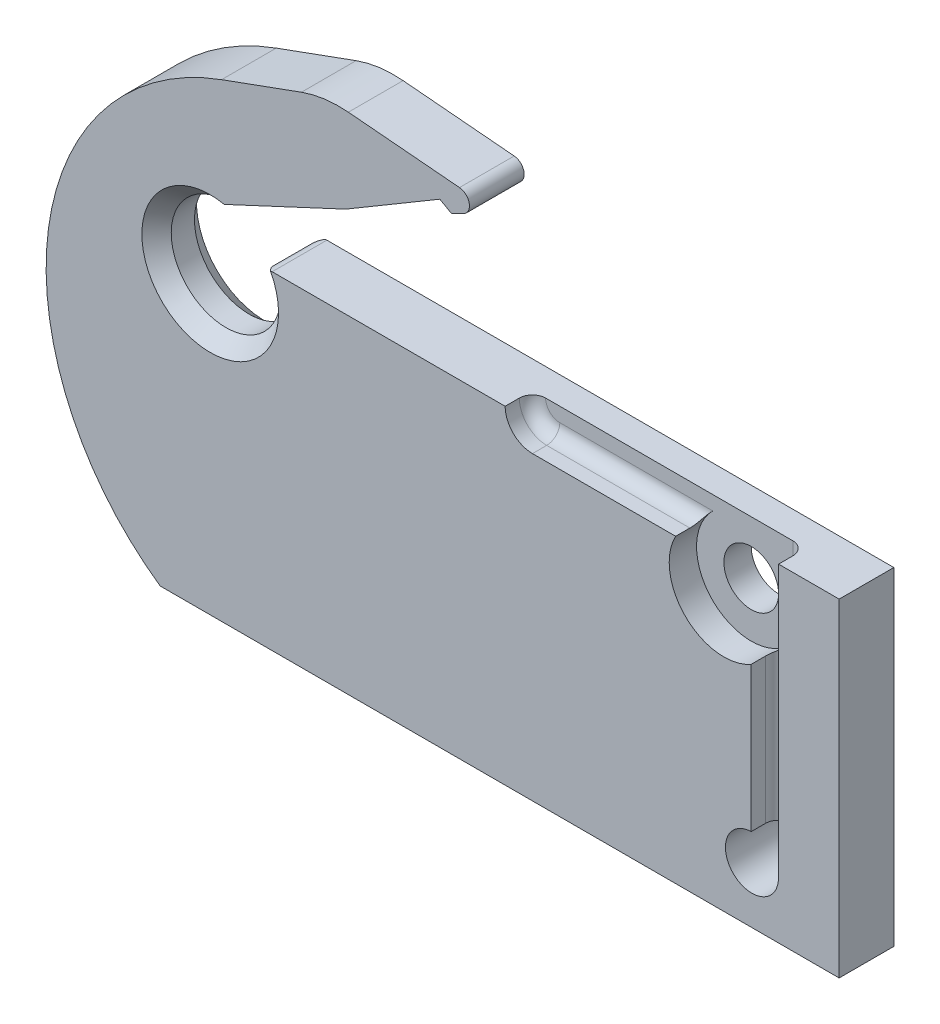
ISO-10303-21;
HEADER;
FILE_DESCRIPTION(('STEP AP214'),'2;1');
FILE_NAME('part.step','',(''),(''),'','','');
FILE_SCHEMA(('AUTOMOTIVE_DESIGN { 1 0 10303 214 1 1 1 1 }'));
ENDSEC;
DATA;
#1=APPLICATION_CONTEXT('core data for automotive mechanical design processes');
#2=APPLICATION_PROTOCOL_DEFINITION('international standard','automotive_design',2000,#1);
#3=PRODUCT_CONTEXT('',#1,'mechanical');
#4=PRODUCT('Part','Part','',(#3));
#5=PRODUCT_RELATED_PRODUCT_CATEGORY('part','',(#4));
#6=PRODUCT_DEFINITION_FORMATION('','',#4);
#7=PRODUCT_DEFINITION_CONTEXT('part definition',#1,'design');
#8=PRODUCT_DEFINITION('design','',#6,#7);
#9=PRODUCT_DEFINITION_SHAPE('','',#8);
#10=(LENGTH_UNIT() NAMED_UNIT(*) SI_UNIT(.MILLI.,.METRE.));
#11=(NAMED_UNIT(*) PLANE_ANGLE_UNIT() SI_UNIT($,.RADIAN.));
#12=(NAMED_UNIT(*) SI_UNIT($,.STERADIAN.) SOLID_ANGLE_UNIT());
#13=UNCERTAINTY_MEASURE_WITH_UNIT(LENGTH_MEASURE(1.E-05),#10,'distance_accuracy_value','');
#14=(GEOMETRIC_REPRESENTATION_CONTEXT(3) GLOBAL_UNCERTAINTY_ASSIGNED_CONTEXT((#13)) GLOBAL_UNIT_ASSIGNED_CONTEXT((#10,
#11,#12)) REPRESENTATION_CONTEXT('',''));
#15=CARTESIAN_POINT('',(0.,0.,0.));
#16=DIRECTION('',(0.,0.,1.));
#17=DIRECTION('',(1.,0.,0.));
#18=AXIS2_PLACEMENT_3D('',#15,#16,#17);
#19=CARTESIAN_POINT('',(-54.5404484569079,6.16115859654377,3.175));
#20=DIRECTION('',(0.,-1.,0.));
#21=DIRECTION('',(0.,0.,-1.));
#22=AXIS2_PLACEMENT_3D('',#19,#20,#21);
#23=PLANE('',#22);
#24=DIRECTION('',(-1.,0.,0.));
#25=VECTOR('',#24,1.);
#26=CARTESIAN_POINT('',(-54.5404484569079,6.16115859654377,0.));
#27=LINE('',#26,#25);
#28=CARTESIAN_POINT('',(4.826,6.16115859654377,0.));
#29=VERTEX_POINT('',#28);
#30=CARTESIAN_POINT('',(-23.876,6.16115859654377,0.));
#31=VERTEX_POINT('',#30);
#32=EDGE_CURVE('E266',#29,#31,#27,.T.);
#33=ORIENTED_EDGE('',*,*,#32,.F.);
#34=CARTESIAN_POINT('',(4.82599999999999,6.16115859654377,1.524));
#35=DIRECTION('',(0.,-1.,0.));
#36=DIRECTION('',(0.,0.,-1.));
#37=AXIS2_PLACEMENT_3D('',#34,#35,#36);
#38=CIRCLE('',#37,1.524);
#39=CARTESIAN_POINT('',(6.34999999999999,6.16115859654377,1.524));
#40=VERTEX_POINT('',#39);
#41=EDGE_CURVE('E11',#29,#40,#38,.T.);
#42=ORIENTED_EDGE('',*,*,#41,.T.);
#43=DIRECTION('',(0.,0.,1.));
#44=VECTOR('',#43,1.);
#45=CARTESIAN_POINT('',(6.34999999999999,6.16115859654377,3.175));
#46=LINE('',#45,#44);
#47=CARTESIAN_POINT('',(6.34999999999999,6.16115859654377,3.175));
#48=VERTEX_POINT('',#47);
#49=EDGE_CURVE('E258',#40,#48,#46,.T.);
#50=ORIENTED_EDGE('',*,*,#49,.T.);
#51=DIRECTION('',(-1.,0.,0.));
#52=VECTOR('',#51,1.);
#53=CARTESIAN_POINT('',(-54.5404484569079,6.16115859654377,3.175));
#54=LINE('',#53,#52);
#55=CARTESIAN_POINT('',(13.3824979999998,6.16115859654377,3.175));
#56=VERTEX_POINT('',#55);
#57=EDGE_CURVE('E484',#56,#48,#54,.T.);
#58=ORIENTED_EDGE('',*,*,#57,.F.);
#59=DIRECTION('',(0.,0.,-1.));
#60=VECTOR('',#59,1.);
#61=CARTESIAN_POINT('',(13.3824979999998,6.16115859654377,3.175));
#62=LINE('',#61,#60);
#63=CARTESIAN_POINT('',(13.3824979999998,6.16115859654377,-3.175));
#64=VERTEX_POINT('',#63);
#65=EDGE_CURVE('E478',#56,#64,#62,.T.);
#66=ORIENTED_EDGE('',*,*,#65,.T.);
#67=DIRECTION('',(-1.,0.,0.));
#68=VECTOR('',#67,1.);
#69=CARTESIAN_POINT('',(-54.5404484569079,6.16115859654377,-3.175));
#70=LINE('',#69,#68);
#71=CARTESIAN_POINT('',(-52.4479062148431,6.16115859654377,-3.175));
#72=VERTEX_POINT('',#71);
#73=EDGE_CURVE('E485',#64,#72,#70,.T.);
#74=ORIENTED_EDGE('',*,*,#73,.T.);
#75=DIRECTION('',(0.,0.,-1.));
#76=VECTOR('',#75,1.);
#77=CARTESIAN_POINT('',(-52.4479062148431,6.16115859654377,3.175));
#78=LINE('',#77,#76);
#79=CARTESIAN_POINT('',(-52.4479062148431,6.16115859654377,3.175));
#80=VERTEX_POINT('',#79);
#81=EDGE_CURVE('E451',#72,#80,#78,.F.);
#82=ORIENTED_EDGE('',*,*,#81,.T.);
#83=CARTESIAN_POINT('',(-25.4,6.16115859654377,3.175));
#84=VERTEX_POINT('',#83);
#85=EDGE_CURVE('E505',#84,#80,#54,.T.);
#86=ORIENTED_EDGE('',*,*,#85,.F.);
#87=DIRECTION('',(0.,0.,1.));
#88=VECTOR('',#87,1.);
#89=CARTESIAN_POINT('',(-25.4,6.16115859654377,-31.9083550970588));
#90=LINE('',#89,#88);
#91=CARTESIAN_POINT('',(-25.4,6.16115859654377,1.524));
#92=VERTEX_POINT('',#91);
#93=EDGE_CURVE('E250',#92,#84,#90,.T.);
#94=ORIENTED_EDGE('',*,*,#93,.F.);
#95=CARTESIAN_POINT('',(-23.876,6.16115859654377,1.524));
#96=DIRECTION('',(0.,-1.,0.));
#97=DIRECTION('',(0.,0.,-1.));
#98=AXIS2_PLACEMENT_3D('',#95,#96,#97);
#99=CIRCLE('',#98,1.524);
#100=EDGE_CURVE('E370',#92,#31,#99,.T.);
#101=ORIENTED_EDGE('',*,*,#100,.T.);
#102=EDGE_LOOP('',(#33,#42,#50,#58,#66,#74,#82,#86,#94,#101));
#103=FACE_BOUND('',#102,.T.);
#104=ADVANCED_FACE('F34',(#103),#23,.F.);
#105=CARTESIAN_POINT('',(0.,0.,-3.175));
#106=DIRECTION('',(0.,0.,1.));
#107=DIRECTION('',(1.,0.,0.));
#108=AXIS2_PLACEMENT_3D('',#105,#106,#107);
#109=CYLINDRICAL_SURFACE('',#108,3.175);
#110=CARTESIAN_POINT('',(0.,0.,-3.175));
#111=DIRECTION('',(0.,0.,1.));
#112=DIRECTION('',(1.,0.,0.));
#113=AXIS2_PLACEMENT_3D('',#110,#111,#112);
#114=CIRCLE('',#113,3.175);
#115=CARTESIAN_POINT('',(3.175,0.,-3.175));
#116=VERTEX_POINT('',#115);
#117=EDGE_CURVE('E269',#116,#116,#114,.T.);
#118=CARTESIAN_POINT('',(0.,0.,0.));
#119=DIRECTION('',(0.,0.,1.));
#120=DIRECTION('',(1.,0.,0.));
#121=AXIS2_PLACEMENT_3D('',#118,#119,#120);
#122=CIRCLE('',#121,3.175);
#123=CARTESIAN_POINT('',(3.175,0.,0.));
#124=VERTEX_POINT('',#123);
#125=EDGE_CURVE('E264',#124,#124,#122,.F.);
#126=CARTESIAN_POINT('',(3.175,0.,-3.175));
#127=CARTESIAN_POINT('',(3.175,0.,-3.14192708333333));
#128=CARTESIAN_POINT('',(3.175,0.,-3.10885416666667));
#129=CARTESIAN_POINT('',(3.175,0.,-3.04270833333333));
#130=CARTESIAN_POINT('',(3.175,0.,-3.00963541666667));
#131=CARTESIAN_POINT('',(3.175,0.,-2.94348958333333));
#132=CARTESIAN_POINT('',(3.175,0.,-2.91041666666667));
#133=CARTESIAN_POINT('',(3.175,0.,-2.84427083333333));
#134=CARTESIAN_POINT('',(3.175,0.,-2.81119791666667));
#135=CARTESIAN_POINT('',(3.175,0.,-2.74505208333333));
#136=CARTESIAN_POINT('',(3.175,0.,-2.71197916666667));
#137=CARTESIAN_POINT('',(3.175,0.,-2.64583333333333));
#138=CARTESIAN_POINT('',(3.175,0.,-2.61276041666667));
#139=CARTESIAN_POINT('',(3.175,0.,-2.54661458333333));
#140=CARTESIAN_POINT('',(3.175,0.,-2.51354166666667));
#141=CARTESIAN_POINT('',(3.175,0.,-2.44739583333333));
#142=CARTESIAN_POINT('',(3.175,0.,-2.41432291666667));
#143=CARTESIAN_POINT('',(3.175,0.,-2.34817708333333));
#144=CARTESIAN_POINT('',(3.175,0.,-2.31510416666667));
#145=CARTESIAN_POINT('',(3.175,0.,-2.24895833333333));
#146=CARTESIAN_POINT('',(3.175,0.,-2.21588541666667));
#147=CARTESIAN_POINT('',(3.175,0.,-2.14973958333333));
#148=CARTESIAN_POINT('',(3.175,0.,-2.11666666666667));
#149=CARTESIAN_POINT('',(3.175,0.,-2.05052083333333));
#150=CARTESIAN_POINT('',(3.175,0.,-2.01744791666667));
#151=CARTESIAN_POINT('',(3.175,0.,-1.95130208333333));
#152=CARTESIAN_POINT('',(3.175,0.,-1.91822916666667));
#153=CARTESIAN_POINT('',(3.175,0.,-1.85208333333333));
#154=CARTESIAN_POINT('',(3.175,0.,-1.81901041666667));
#155=CARTESIAN_POINT('',(3.175,0.,-1.75286458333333));
#156=CARTESIAN_POINT('',(3.175,0.,-1.71979166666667));
#157=CARTESIAN_POINT('',(3.175,0.,-1.65364583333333));
#158=CARTESIAN_POINT('',(3.175,0.,-1.62057291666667));
#159=CARTESIAN_POINT('',(3.175,0.,-1.55442708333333));
#160=CARTESIAN_POINT('',(3.175,0.,-1.52135416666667));
#161=CARTESIAN_POINT('',(3.175,0.,-1.45520833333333));
#162=CARTESIAN_POINT('',(3.175,0.,-1.42213541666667));
#163=CARTESIAN_POINT('',(3.175,0.,-1.35598958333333));
#164=CARTESIAN_POINT('',(3.175,0.,-1.32291666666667));
#165=CARTESIAN_POINT('',(3.175,0.,-1.25677083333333));
#166=CARTESIAN_POINT('',(3.175,0.,-1.22369791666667));
#167=CARTESIAN_POINT('',(3.175,0.,-1.15755208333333));
#168=CARTESIAN_POINT('',(3.175,0.,-1.12447916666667));
#169=CARTESIAN_POINT('',(3.175,0.,-1.05833333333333));
#170=CARTESIAN_POINT('',(3.175,0.,-1.02526041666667));
#171=CARTESIAN_POINT('',(3.175,0.,-0.959114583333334));
#172=CARTESIAN_POINT('',(3.175,0.,-0.926041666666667));
#173=CARTESIAN_POINT('',(3.175,0.,-0.859895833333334));
#174=CARTESIAN_POINT('',(3.175,0.,-0.826822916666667));
#175=CARTESIAN_POINT('',(3.175,0.,-0.760677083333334));
#176=CARTESIAN_POINT('',(3.175,0.,-0.727604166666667));
#177=CARTESIAN_POINT('',(3.175,0.,-0.661458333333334));
#178=CARTESIAN_POINT('',(3.175,0.,-0.628385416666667));
#179=CARTESIAN_POINT('',(3.175,0.,-0.562239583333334));
#180=CARTESIAN_POINT('',(3.175,0.,-0.529166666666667));
#181=CARTESIAN_POINT('',(3.175,0.,-0.463020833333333));
#182=CARTESIAN_POINT('',(3.175,0.,-0.429947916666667));
#183=CARTESIAN_POINT('',(3.175,0.,-0.363802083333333));
#184=CARTESIAN_POINT('',(3.175,0.,-0.330729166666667));
#185=CARTESIAN_POINT('',(3.175,0.,-0.264583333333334));
#186=CARTESIAN_POINT('',(3.175,0.,-0.231510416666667));
#187=CARTESIAN_POINT('',(3.175,0.,-0.165364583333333));
#188=CARTESIAN_POINT('',(3.175,0.,-0.132291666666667));
#189=CARTESIAN_POINT('',(3.175,0.,-0.0661458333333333));
#190=CARTESIAN_POINT('',(3.175,0.,-0.0330729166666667));
#191=CARTESIAN_POINT('',(3.175,0.,0.));
#192=B_SPLINE_CURVE_WITH_KNOTS('',3,(#126,#127,#128,#129,#130,#131,#132,#133,#134,#135,#136,
#137,#138,#139,#140,#141,#142,#143,#144,#145,#146,#147,#148,#149,#150,#151,#152,#153,#154,#155,
#156,#157,#158,#159,#160,#161,#162,#163,#164,#165,#166,#167,#168,#169,#170,#171,#172,#173,#174,
#175,#176,#177,#178,#179,#180,#181,#182,#183,#184,#185,#186,#187,#188,#189,#190,#191),
.UNSPECIFIED.,.F.,.F.,(4,2,2,2,2,2,2,2,2,2,2,2,2,2,2,2,2,2,2,2,2,2,2,2,2,2,2,2,2,2,2,2,4),(0.,
0.0992187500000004,0.1984375,0.29765625,0.396875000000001,0.49609375,0.5953125,0.69453125,
0.79375,0.892968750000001,0.9921875,1.09140625,1.190625,1.28984375,1.3890625,1.48828125,1.5875,
1.68671875,1.7859375,1.88515625,1.984375,2.08359375,2.1828125,2.28203125,2.38125,2.48046875,
2.5796875,2.67890625,2.778125,2.87734375,2.9765625,3.07578125,3.175),.UNSPECIFIED.);
#193=EDGE_CURVE('BSEAM384',#116,#124,#192,.T.);
#194=ORIENTED_EDGE('',*,*,#117,.F.);
#195=ORIENTED_EDGE('',*,*,#125,.F.);
#196=ORIENTED_EDGE('',*,*,#193,.T.);
#197=ORIENTED_EDGE('',*,*,#193,.F.);
#198=EDGE_LOOP('',(#194,#196,#195,#197));
#199=FACE_BOUND('',#198,.T.);
#200=ADVANCED_FACE('F384',(#199),#109,.F.);
#201=CARTESIAN_POINT('',(-25.9759161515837,25.0861785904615,3.175));
#202=DIRECTION('',(-0.422618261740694,0.906307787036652,0.));
#203=DIRECTION('',(-0.906307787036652,-0.422618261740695,0.));
#204=AXIS2_PLACEMENT_3D('',#201,#202,#203);
#205=PLANE('',#204);
#206=DIRECTION('',(0.906307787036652,0.422618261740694,0.));
#207=VECTOR('',#206,1.);
#208=CARTESIAN_POINT('',(-25.9759161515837,25.0861785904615,-3.175));
#209=LINE('',#208,#207);
#210=CARTESIAN_POINT('',(-58.0098371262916,10.1485159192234,-3.17500000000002));
#211=VERTEX_POINT('',#210);
#212=CARTESIAN_POINT('',(-43.9119719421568,16.7224584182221,-3.175));
#213=VERTEX_POINT('',#212);
#214=EDGE_CURVE('E499',#211,#213,#209,.T.);
#215=ORIENTED_EDGE('',*,*,#214,.T.);
#216=DIRECTION('',(0.,0.,1.));
#217=VECTOR('',#216,1.);
#218=CARTESIAN_POINT('',(-43.9119719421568,16.7224584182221,-3.175));
#219=LINE('',#218,#217);
#220=CARTESIAN_POINT('',(-43.9119719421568,16.7224584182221,3.175));
#221=VERTEX_POINT('',#220);
#222=EDGE_CURVE('E284',#213,#221,#219,.T.);
#223=ORIENTED_EDGE('',*,*,#222,.T.);
#224=DIRECTION('',(0.906307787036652,0.422618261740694,0.));
#225=VECTOR('',#224,1.);
#226=CARTESIAN_POINT('',(-25.9759161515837,25.0861785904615,3.175));
#227=LINE('',#226,#225);
#228=CARTESIAN_POINT('',(-58.0098371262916,10.1485159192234,3.17499999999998));
#229=VERTEX_POINT('',#228);
#230=EDGE_CURVE('E438',#229,#221,#227,.T.);
#231=ORIENTED_EDGE('',*,*,#230,.F.);
#232=CARTESIAN_POINT('',(-62.3263279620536,8.13570318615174,1.34879015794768));
#233=CARTESIAN_POINT('',(-62.2517896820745,8.17046095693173,1.34878160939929));
#234=CARTESIAN_POINT('',(-62.1772616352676,8.20521395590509,1.35062246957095));
#235=CARTESIAN_POINT('',(-62.0283623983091,8.27464681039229,1.35795265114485));
#236=CARTESIAN_POINT('',(-61.9539911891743,8.3093266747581,1.36344150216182));
#237=CARTESIAN_POINT('',(-61.7315496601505,8.41305286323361,1.38527960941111));
#238=CARTESIAN_POINT('',(-61.5838883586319,8.48190845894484,1.40700076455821));
#239=CARTESIAN_POINT('',(-61.2934227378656,8.61735480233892,1.46326730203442));
#240=CARTESIAN_POINT('',(-61.1505789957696,8.68396393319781,1.49757048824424));
#241=CARTESIAN_POINT('',(-60.8675653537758,8.81593536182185,1.57770576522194));
#242=CARTESIAN_POINT('',(-60.7273961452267,8.88129733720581,1.62354079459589));
#243=CARTESIAN_POINT('',(-60.3611694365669,9.05207165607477,1.75788266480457));
#244=CARTESIAN_POINT('',(-60.1376762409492,9.15628824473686,1.85490496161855));
#245=CARTESIAN_POINT('',(-59.6988537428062,9.36091453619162,2.0698548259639));
#246=CARTESIAN_POINT('',(-59.4835389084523,9.46131749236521,2.18781752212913));
#247=CARTESIAN_POINT('',(-59.1629383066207,9.61081600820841,2.37858011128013));
#248=CARTESIAN_POINT('',(-59.054791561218,9.66124566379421,2.44563739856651));
#249=CARTESIAN_POINT('',(-58.8404072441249,9.76121471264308,2.58339822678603));
#250=CARTESIAN_POINT('',(-58.7341698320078,9.81075403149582,2.65410207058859));
#251=CARTESIAN_POINT('',(-58.5239313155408,9.90878986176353,2.79833872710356));
#252=CARTESIAN_POINT('',(-58.4199225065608,9.95728996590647,2.87185793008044));
#253=CARTESIAN_POINT('',(-58.2135548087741,10.0535208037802,3.02159730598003));
#254=CARTESIAN_POINT('',(-58.1111954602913,10.1012517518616,3.09781670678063));
#255=CARTESIAN_POINT('',(-58.0095745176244,10.148638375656,3.17520000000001));
#256=B_SPLINE_CURVE_WITH_KNOTS('',3,(#232,#233,#234,#235,#236,#237,#238,#239,#240,#241,#242,
#243,#244,#245,#246,#247,#248,#249,#250,#251,#252,#253,#254,#255),.UNSPECIFIED.,.F.,.F.,(4,2,2,
2,2,2,2,2,2,2,2,4),(0.,0.246689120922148,0.493346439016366,0.98579334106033,1.46921983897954,
1.95276965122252,2.74640800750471,3.54139053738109,3.95197114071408,4.36258590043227,
4.77141856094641,5.18013524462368),.UNSPECIFIED.);
#257=CARTESIAN_POINT('',(-62.3261279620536,8.13579644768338,1.34879015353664));
#258=VERTEX_POINT('',#257);
#259=EDGE_CURVE('E297',#258,#229,#256,.T.);
#260=ORIENTED_EDGE('',*,*,#259,.F.);
#261=DIRECTION('',(0.,0.,-1.));
#262=VECTOR('',#261,1.);
#263=CARTESIAN_POINT('',(-62.3261279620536,8.13579644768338,3.175));
#264=LINE('',#263,#262);
#265=CARTESIAN_POINT('',(-62.3261279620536,8.13579644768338,-1.34879015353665));
#266=VERTEX_POINT('',#265);
#267=EDGE_CURVE('E481',#258,#266,#264,.T.);
#268=ORIENTED_EDGE('',*,*,#267,.T.);
#269=CARTESIAN_POINT('',(-58.0095745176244,10.148638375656,-3.17520000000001));
#270=CARTESIAN_POINT('',(-58.1091727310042,10.1021949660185,-3.09935630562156));
#271=CARTESIAN_POINT('',(-58.209480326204,10.0554207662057,-3.02463147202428));
#272=CARTESIAN_POINT('',(-58.4116752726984,9.96113571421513,-2.87776856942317));
#273=CARTESIAN_POINT('',(-58.513563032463,9.91362467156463,-2.8056311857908));
#274=CARTESIAN_POINT('',(-58.7194338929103,9.81762551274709,-2.66405272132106));
#275=CARTESIAN_POINT('',(-58.8234236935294,9.76913427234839,-2.59462344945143));
#276=CARTESIAN_POINT('',(-59.033228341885,9.67130075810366,-2.45923461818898));
#277=CARTESIAN_POINT('',(-59.1390430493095,9.62195854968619,-2.39327479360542));
#278=CARTESIAN_POINT('',(-59.4528676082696,9.47561975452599,-2.20529492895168));
#279=CARTESIAN_POINT('',(-59.6636161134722,9.3773461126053,-2.08873878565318));
#280=CARTESIAN_POINT('',(-60.092992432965,9.17712464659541,-1.87545103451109));
#281=CARTESIAN_POINT('',(-60.3116080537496,9.07518250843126,-1.77869018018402));
#282=CARTESIAN_POINT('',(-60.6769104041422,8.90483922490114,-1.64084769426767));
#283=CARTESIAN_POINT('',(-60.8212632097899,8.83752640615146,-1.59224477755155));
#284=CARTESIAN_POINT('',(-61.1128628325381,8.70155126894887,-1.50718201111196));
#285=CARTESIAN_POINT('',(-61.260108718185,8.63288938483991,-1.47071831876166));
#286=CARTESIAN_POINT('',(-61.5597146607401,8.49318083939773,-1.41084635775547));
#287=CARTESIAN_POINT('',(-61.7121187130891,8.42211366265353,-1.38769984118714));
#288=CARTESIAN_POINT('',(-61.941776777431,8.31502234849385,-1.36441849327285));
#289=CARTESIAN_POINT('',(-62.0185807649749,8.2792080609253,-1.35856433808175));
#290=CARTESIAN_POINT('',(-62.1723620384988,8.20749867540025,-1.35074518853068));
#291=CARTESIAN_POINT('',(-62.2493393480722,8.17160356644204,-1.34878076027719));
#292=CARTESIAN_POINT('',(-62.3263279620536,8.13570318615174,-1.34879015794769));
#293=B_SPLINE_CURVE_WITH_KNOTS('',3,(#269,#270,#271,#272,#273,#274,#275,#276,#277,#278,#279,
#280,#281,#282,#283,#284,#285,#286,#287,#288,#289,#290,#291,#292),.UNSPECIFIED.,.F.,.F.,(4,2,2,
2,2,2,2,2,2,2,2,4),(0.,0.400581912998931,0.801269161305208,1.20354317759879,1.60578640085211,
2.38541709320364,3.16388746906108,3.66306105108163,4.1620764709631,4.67059169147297,
4.9253503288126,5.18014604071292),.UNSPECIFIED.);
#294=EDGE_CURVE('E514',#211,#266,#293,.T.);
#295=ORIENTED_EDGE('',*,*,#294,.F.);
#296=EDGE_LOOP('',(#215,#223,#231,#260,#268,#295));
#297=FACE_BOUND('',#296,.T.);
#298=ADVANCED_FACE('F387',(#297),#205,.F.);
#299=CARTESIAN_POINT('',(-31.6527603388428,22.43902267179,3.175));
#300=VERTEX_POINT('',#299);
#301=CARTESIAN_POINT('',(-30.2715472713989,23.0830929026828,3.175));
#302=VERTEX_POINT('',#301);
#303=EDGE_CURVE('E488',#300,#302,#227,.T.);
#304=ORIENTED_EDGE('',*,*,#303,.F.);
#305=DIRECTION('',(0.,0.,1.));
#306=VECTOR('',#305,1.);
#307=CARTESIAN_POINT('',(-31.6527603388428,22.43902267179,-3.175));
#308=LINE('',#307,#306);
#309=CARTESIAN_POINT('',(-31.6527603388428,22.43902267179,-3.175));
#310=VERTEX_POINT('',#309);
#311=EDGE_CURVE('E280',#310,#300,#308,.T.);
#312=ORIENTED_EDGE('',*,*,#311,.F.);
#313=CARTESIAN_POINT('',(-30.2715472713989,23.0830929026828,-3.175));
#314=VERTEX_POINT('',#313);
#315=EDGE_CURVE('E502',#310,#314,#209,.T.);
#316=ORIENTED_EDGE('',*,*,#315,.T.);
#317=DIRECTION('',(0.,0.,-1.));
#318=VECTOR('',#317,1.);
#319=CARTESIAN_POINT('',(-30.2715472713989,23.0830929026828,3.175));
#320=LINE('',#319,#318);
#321=EDGE_CURVE('E333',#314,#302,#320,.F.);
#322=ORIENTED_EDGE('',*,*,#321,.T.);
#323=EDGE_LOOP('',(#304,#312,#316,#322));
#324=FACE_BOUND('',#323,.T.);
#325=ADVANCED_FACE('F306',(#324),#205,.F.);
#326=CARTESIAN_POINT('',(-59.6425020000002,2.38074200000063,3.175));
#327=DIRECTION('',(0.,0.,-1.));
#328=DIRECTION('',(-1.,0.,0.));
#329=AXIS2_PLACEMENT_3D('',#326,#327,#328);
#330=CYLINDRICAL_SURFACE('',#329,6.35000000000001);
#331=CARTESIAN_POINT('',(-59.6425020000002,2.38074200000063,-1.34879015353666));
#332=DIRECTION('',(0.,0.,-1.));
#333=DIRECTION('',(-1.,0.,0.));
#334=AXIS2_PLACEMENT_3D('',#331,#332,#333);
#335=CIRCLE('',#334,6.35000000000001);
#336=CARTESIAN_POINT('',(-53.6470055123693,4.47275583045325,-1.3487901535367));
#337=VERTEX_POINT('',#336);
#338=EDGE_CURVE('E304',#266,#337,#335,.F.);
#339=ORIENTED_EDGE('',*,*,#338,.F.);
#340=ORIENTED_EDGE('',*,*,#267,.F.);
#341=CARTESIAN_POINT('',(-59.6425020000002,2.38074200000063,1.34879015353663));
#342=DIRECTION('',(0.,0.,1.));
#343=DIRECTION('',(1.,0.,0.));
#344=AXIS2_PLACEMENT_3D('',#341,#342,#343);
#345=CIRCLE('',#344,6.35000000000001);
#346=CARTESIAN_POINT('',(-53.6470055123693,4.47275583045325,1.34879015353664));
#347=VERTEX_POINT('',#346);
#348=EDGE_CURVE('E295',#347,#258,#345,.F.);
#349=ORIENTED_EDGE('',*,*,#348,.F.);
#350=DIRECTION('',(0.,0.,-1.));
#351=VECTOR('',#350,1.);
#352=CARTESIAN_POINT('',(-53.6470055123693,4.47275583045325,3.175));
#353=LINE('',#352,#351);
#354=EDGE_CURVE('E457',#347,#337,#353,.T.);
#355=ORIENTED_EDGE('',*,*,#354,.T.);
#356=EDGE_LOOP('',(#339,#340,#349,#355));
#357=FACE_BOUND('',#356,.T.);
#358=ADVANCED_FACE('F406',(#357),#330,.F.);
#359=CARTESIAN_POINT('',(-59.6425020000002,2.38074200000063,3.175));
#360=DIRECTION('',(0.,0.,-1.));
#361=DIRECTION('',(-1.,0.,0.));
#362=AXIS2_PLACEMENT_3D('',#359,#360,#361);
#363=PLANE('',#362);
#364=DIRECTION('',(1.,0.,0.));
#365=VECTOR('',#364,1.);
#366=CARTESIAN_POINT('',(3.175,-25.4,3.175));
#367=LINE('',#366,#365);
#368=CARTESIAN_POINT('',(6.3368592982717,-25.4,3.175));
#369=VERTEX_POINT('',#368);
#370=CARTESIAN_POINT('',(6.34999999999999,-25.4,3.175));
#371=VERTEX_POINT('',#370);
#372=EDGE_CURVE('E239',#369,#371,#367,.T.);
#373=ORIENTED_EDGE('',*,*,#372,.F.);
#374=CARTESIAN_POINT('',(3.2562799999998,-25.4,3.175));
#375=DIRECTION('',(0.,0.,1.));
#376=DIRECTION('',(1.,0.,0.));
#377=AXIS2_PLACEMENT_3D('',#374,#375,#376);
#378=CIRCLE('',#377,3.0805792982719);
#379=CARTESIAN_POINT('',(3.175,-22.3204931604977,3.175));
#380=VERTEX_POINT('',#379);
#381=EDGE_CURVE('E220',#380,#369,#378,.T.);
#382=ORIENTED_EDGE('',*,*,#381,.F.);
#383=DIRECTION('',(0.,-1.,0.));
#384=VECTOR('',#383,1.);
#385=CARTESIAN_POINT('',(3.175,12.7,3.175));
#386=LINE('',#385,#384);
#387=CARTESIAN_POINT('',(3.175,-5.49926131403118,3.175));
#388=VERTEX_POINT('',#387);
#389=EDGE_CURVE('E236',#388,#380,#386,.T.);
#390=ORIENTED_EDGE('',*,*,#389,.F.);
#391=CARTESIAN_POINT('',(0.,0.,3.175));
#392=DIRECTION('',(0.,0.,1.));
#393=DIRECTION('',(1.,0.,0.));
#394=AXIS2_PLACEMENT_3D('',#391,#392,#393);
#395=CIRCLE('',#394,6.34999999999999);
#396=CARTESIAN_POINT('',(-5.60404825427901,2.98615859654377,3.175));
#397=VERTEX_POINT('',#396);
#398=EDGE_CURVE('E261',#397,#388,#395,.T.);
#399=ORIENTED_EDGE('',*,*,#398,.F.);
#400=DIRECTION('',(1.,0.,0.));
#401=VECTOR('',#400,1.);
#402=CARTESIAN_POINT('',(-22.225,2.98615859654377,3.175));
#403=LINE('',#402,#401);
#404=CARTESIAN_POINT('',(-22.225,2.98615859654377,3.175));
#405=VERTEX_POINT('',#404);
#406=EDGE_CURVE('E744',#405,#397,#403,.T.);
#407=ORIENTED_EDGE('',*,*,#406,.F.);
#408=CARTESIAN_POINT('',(-22.225,6.16115859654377,3.175));
#409=DIRECTION('',(0.,0.,1.));
#410=DIRECTION('',(1.,0.,0.));
#411=AXIS2_PLACEMENT_3D('',#408,#409,#410);
#412=CIRCLE('',#411,3.175);
#413=EDGE_CURVE('E229',#84,#405,#412,.T.);
#414=ORIENTED_EDGE('',*,*,#413,.F.);
#415=ORIENTED_EDGE('',*,*,#85,.T.);
#416=CARTESIAN_POINT('',(-52.4479062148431,4.89115859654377,3.175));
#417=DIRECTION('',(0.,0.,-1.));
#418=DIRECTION('',(-1.,0.,0.));
#419=AXIS2_PLACEMENT_3D('',#416,#417,#418);
#420=CIRCLE('',#419,1.27);
#421=CARTESIAN_POINT('',(-52.6539874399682,6.14432679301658,3.175));
#422=VERTEX_POINT('',#421);
#423=EDGE_CURVE('E445',#80,#422,#420,.F.);
#424=ORIENTED_EDGE('',*,*,#423,.T.);
#425=CARTESIAN_POINT('',(-59.6425020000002,2.38074200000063,3.17499999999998));
#426=DIRECTION('',(0.,0.,-1.));
#427=DIRECTION('',(-1.,0.,0.));
#428=AXIS2_PLACEMENT_3D('',#425,#426,#427);
#429=CIRCLE('',#428,7.93750000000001);
#430=EDGE_CURVE('E292',#422,#229,#429,.T.);
#431=ORIENTED_EDGE('',*,*,#430,.T.);
#432=ORIENTED_EDGE('',*,*,#230,.T.);
#433=DIRECTION('',(-0.860747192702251,-0.509032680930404,0.));
#434=VECTOR('',#433,1.);
#435=CARTESIAN_POINT('',(-32.9804825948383,23.1871734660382,3.175));
#436=LINE('',#435,#434);
#437=CARTESIAN_POINT('',(-32.9804825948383,23.1871734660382,3.175));
#438=VERTEX_POINT('',#437);
#439=EDGE_CURVE('E277',#438,#221,#436,.T.);
#440=ORIENTED_EDGE('',*,*,#439,.F.);
#441=DIRECTION('',(-0.871208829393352,0.490912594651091,0.));
#442=VECTOR('',#441,1.);
#443=CARTESIAN_POINT('',(-31.6527603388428,22.43902267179,3.175));
#444=LINE('',#443,#442);
#445=EDGE_CURVE('E272',#300,#438,#444,.T.);
#446=ORIENTED_EDGE('',*,*,#445,.F.);
#447=ORIENTED_EDGE('',*,*,#303,.T.);
#448=CARTESIAN_POINT('',(-30.8082724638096,24.2341037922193,3.175));
#449=DIRECTION('',(0.,0.,-1.));
#450=DIRECTION('',(-1.,0.,0.));
#451=AXIS2_PLACEMENT_3D('',#448,#449,#450);
#452=CIRCLE('',#451,1.27);
#453=CARTESIAN_POINT('',(-30.69758467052,25.4992710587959,3.175));
#454=VERTEX_POINT('',#453);
#455=EDGE_CURVE('E442',#302,#454,#452,.F.);
#456=ORIENTED_EDGE('',*,*,#455,.T.);
#457=DIRECTION('',(-0.996194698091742,0.0871557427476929,0.));
#458=VECTOR('',#457,1.);
#459=CARTESIAN_POINT('',(-46.404448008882,26.873443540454,3.175));
#460=LINE('',#459,#458);
#461=CARTESIAN_POINT('',(-43.5996397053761,26.6280546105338,3.175));
#462=VERTEX_POINT('',#461);
#463=EDGE_CURVE('E430',#454,#462,#460,.T.);
#464=ORIENTED_EDGE('',*,*,#463,.T.);
#465=CARTESIAN_POINT('',(-44.7065176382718,13.9763819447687,3.175));
#466=DIRECTION('',(0.,0.,-1.));
#467=DIRECTION('',(-1.,0.,0.));
#468=AXIS2_PLACEMENT_3D('',#465,#466,#467);
#469=CIRCLE('',#468,12.7);
#470=CARTESIAN_POINT('',(-49.0501734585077,25.9104782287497,3.175));
#471=VERTEX_POINT('',#470);
#472=EDGE_CURVE('E460',#462,#471,#469,.F.);
#473=ORIENTED_EDGE('',*,*,#472,.T.);
#474=DIRECTION('',(-0.939692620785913,-0.342020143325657,0.));
#475=VECTOR('',#474,1.);
#476=CARTESIAN_POINT('',(-58.3239130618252,22.5351130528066,3.175));
#477=LINE('',#476,#475);
#478=CARTESIAN_POINT('',(-58.3239130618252,22.5351130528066,3.175));
#479=VERTEX_POINT('',#478);
#480=EDGE_CURVE('E437',#471,#479,#477,.T.);
#481=ORIENTED_EDGE('',*,*,#480,.T.);
#482=CARTESIAN_POINT('',(-47.7362520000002,-6.55424663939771,3.175));
#483=DIRECTION('',(0.,0.,1.));
#484=DIRECTION('',(-1.,0.,0.));
#485=AXIS2_PLACEMENT_3D('',#482,#483,#484);
#486=CIRCLE('',#485,30.9562500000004);
#487=CARTESIAN_POINT('',(-65.4538072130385,-31.9388414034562,3.175));
#488=VERTEX_POINT('',#487);
#489=EDGE_CURVE('E510',#479,#488,#486,.T.);
#490=ORIENTED_EDGE('',*,*,#489,.T.);
#491=DIRECTION('',(1.,0.,0.));
#492=VECTOR('',#491,1.);
#493=CARTESIAN_POINT('',(-65.4538072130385,-31.9388414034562,3.175));
#494=LINE('',#493,#492);
#495=CARTESIAN_POINT('',(13.3824979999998,-31.9388414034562,3.175));
#496=VERTEX_POINT('',#495);
#497=EDGE_CURVE('E508',#488,#496,#494,.T.);
#498=ORIENTED_EDGE('',*,*,#497,.T.);
#499=DIRECTION('',(0.,1.,0.));
#500=VECTOR('',#499,1.);
#501=CARTESIAN_POINT('',(13.3824979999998,6.16115859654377,3.175));
#502=LINE('',#501,#500);
#503=EDGE_CURVE('E506',#496,#56,#502,.T.);
#504=ORIENTED_EDGE('',*,*,#503,.T.);
#505=ORIENTED_EDGE('',*,*,#57,.T.);
#506=DIRECTION('',(0.,1.,0.));
#507=VECTOR('',#506,1.);
#508=CARTESIAN_POINT('',(6.34999999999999,12.7,3.175));
#509=LINE('',#508,#507);
#510=EDGE_CURVE('E248',#371,#48,#509,.T.);
#511=ORIENTED_EDGE('',*,*,#510,.F.);
#512=EDGE_LOOP('',(#373,#382,#390,#399,#407,#414,#415,#424,#431,#432,#440,#446,#447,#456,#464,
#473,#481,#490,#498,#504,#505,#511));
#513=FACE_BOUND('',#512,.T.);
#514=ADVANCED_FACE('F234',(#513),#363,.F.);
#515=CARTESIAN_POINT('',(-59.6425020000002,2.38074200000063,-3.175));
#516=DIRECTION('',(0.,0.,-1.));
#517=DIRECTION('',(-1.,0.,0.));
#518=AXIS2_PLACEMENT_3D('',#515,#516,#517);
#519=PLANE('',#518);
#520=CARTESIAN_POINT('',(3.2562799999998,-25.4,-3.175));
#521=DIRECTION('',(0.,0.,1.));
#522=DIRECTION('',(1.,0.,0.));
#523=AXIS2_PLACEMENT_3D('',#520,#521,#522);
#524=CIRCLE('',#523,3.0805792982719);
#525=CARTESIAN_POINT('',(6.3368592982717,-25.4,-3.175));
#526=VERTEX_POINT('',#525);
#527=EDGE_CURVE('E240',#526,#526,#524,.T.);
#528=ORIENTED_EDGE('',*,*,#527,.T.);
#529=EDGE_LOOP('',(#528));
#530=FACE_BOUND('',#529,.T.);
#531=ORIENTED_EDGE('',*,*,#117,.T.);
#532=EDGE_LOOP('',(#531));
#533=FACE_BOUND('',#532,.T.);
#534=DIRECTION('',(-0.860747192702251,-0.509032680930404,0.));
#535=VECTOR('',#534,1.);
#536=CARTESIAN_POINT('',(-32.9804825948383,23.1871734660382,-3.175));
#537=LINE('',#536,#535);
#538=CARTESIAN_POINT('',(-32.9804825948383,23.1871734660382,-3.175));
#539=VERTEX_POINT('',#538);
#540=EDGE_CURVE('E276',#539,#213,#537,.T.);
#541=ORIENTED_EDGE('',*,*,#540,.T.);
#542=ORIENTED_EDGE('',*,*,#214,.F.);
#543=CARTESIAN_POINT('',(-59.6425020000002,2.38074200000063,-3.17500000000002));
#544=DIRECTION('',(0.,0.,-1.));
#545=DIRECTION('',(-1.,0.,0.));
#546=AXIS2_PLACEMENT_3D('',#543,#544,#545);
#547=CIRCLE('',#546,7.93749999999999);
#548=CARTESIAN_POINT('',(-52.6539874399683,6.14432679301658,-3.17500000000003));
#549=VERTEX_POINT('',#548);
#550=EDGE_CURVE('E287',#549,#211,#547,.T.);
#551=ORIENTED_EDGE('',*,*,#550,.F.);
#552=CARTESIAN_POINT('',(-52.4479062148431,4.89115859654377,-3.175));
#553=DIRECTION('',(0.,0.,-1.));
#554=DIRECTION('',(-1.,0.,0.));
#555=AXIS2_PLACEMENT_3D('',#552,#553,#554);
#556=CIRCLE('',#555,1.27);
#557=EDGE_CURVE('E454',#549,#72,#556,.T.);
#558=ORIENTED_EDGE('',*,*,#557,.T.);
#559=ORIENTED_EDGE('',*,*,#73,.F.);
#560=DIRECTION('',(0.,1.,0.));
#561=VECTOR('',#560,1.);
#562=CARTESIAN_POINT('',(13.3824979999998,6.16115859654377,-3.175));
#563=LINE('',#562,#561);
#564=CARTESIAN_POINT('',(13.3824979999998,-31.9388414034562,-3.175));
#565=VERTEX_POINT('',#564);
#566=EDGE_CURVE('E489',#565,#64,#563,.T.);
#567=ORIENTED_EDGE('',*,*,#566,.F.);
#568=DIRECTION('',(1.,0.,0.));
#569=VECTOR('',#568,1.);
#570=CARTESIAN_POINT('',(-65.4538072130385,-31.9388414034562,-3.175));
#571=LINE('',#570,#569);
#572=CARTESIAN_POINT('',(-65.4538072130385,-31.9388414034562,-3.175));
#573=VERTEX_POINT('',#572);
#574=EDGE_CURVE('E491',#573,#565,#571,.T.);
#575=ORIENTED_EDGE('',*,*,#574,.F.);
#576=CARTESIAN_POINT('',(-47.7362520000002,-6.55424663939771,-3.175));
#577=DIRECTION('',(0.,0.,1.));
#578=DIRECTION('',(-1.,0.,0.));
#579=AXIS2_PLACEMENT_3D('',#576,#577,#578);
#580=CIRCLE('',#579,30.9562500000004);
#581=CARTESIAN_POINT('',(-58.3239130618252,22.5351130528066,-3.175));
#582=VERTEX_POINT('',#581);
#583=EDGE_CURVE('E493',#582,#573,#580,.T.);
#584=ORIENTED_EDGE('',*,*,#583,.F.);
#585=DIRECTION('',(-0.939692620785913,-0.342020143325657,0.));
#586=VECTOR('',#585,1.);
#587=CARTESIAN_POINT('',(-58.3239130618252,22.5351130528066,-3.175));
#588=LINE('',#587,#586);
#589=CARTESIAN_POINT('',(-49.0501734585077,25.9104782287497,-3.175));
#590=VERTEX_POINT('',#589);
#591=EDGE_CURVE('E495',#590,#582,#588,.T.);
#592=ORIENTED_EDGE('',*,*,#591,.F.);
#593=CARTESIAN_POINT('',(-44.7065176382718,13.9763819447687,-3.175));
#594=DIRECTION('',(0.,0.,-1.));
#595=DIRECTION('',(-1.,0.,0.));
#596=AXIS2_PLACEMENT_3D('',#593,#594,#595);
#597=CIRCLE('',#596,12.7);
#598=CARTESIAN_POINT('',(-43.5996397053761,26.6280546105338,-3.175));
#599=VERTEX_POINT('',#598);
#600=EDGE_CURVE('E463',#590,#599,#597,.T.);
#601=ORIENTED_EDGE('',*,*,#600,.T.);
#602=DIRECTION('',(-0.996194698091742,0.0871557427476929,0.));
#603=VECTOR('',#602,1.);
#604=CARTESIAN_POINT('',(-46.404448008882,26.873443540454,-3.175));
#605=LINE('',#604,#603);
#606=CARTESIAN_POINT('',(-30.69758467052,25.4992710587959,-3.175));
#607=VERTEX_POINT('',#606);
#608=EDGE_CURVE('E497',#607,#599,#605,.T.);
#609=ORIENTED_EDGE('',*,*,#608,.F.);
#610=CARTESIAN_POINT('',(-30.8082724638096,24.2341037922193,-3.175));
#611=DIRECTION('',(0.,0.,-1.));
#612=DIRECTION('',(-1.,0.,0.));
#613=AXIS2_PLACEMENT_3D('',#610,#611,#612);
#614=CIRCLE('',#613,1.27);
#615=EDGE_CURVE('E444',#607,#314,#614,.T.);
#616=ORIENTED_EDGE('',*,*,#615,.T.);
#617=ORIENTED_EDGE('',*,*,#315,.F.);
#618=DIRECTION('',(-0.871208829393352,0.490912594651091,0.));
#619=VECTOR('',#618,1.);
#620=CARTESIAN_POINT('',(-31.6527603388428,22.43902267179,-3.175));
#621=LINE('',#620,#619);
#622=EDGE_CURVE('E273',#310,#539,#621,.T.);
#623=ORIENTED_EDGE('',*,*,#622,.T.);
#624=EDGE_LOOP('',(#541,#542,#551,#558,#559,#567,#575,#584,#592,#601,#609,#616,#617,#623));
#625=FACE_BOUND('',#624,.T.);
#626=ADVANCED_FACE('F344',(#530,#533,#625),#519,.T.);
#627=CARTESIAN_POINT('',(-52.4479062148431,4.89115859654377,3.175));
#628=DIRECTION('',(0.,0.,-1.));
#629=DIRECTION('',(-1.,0.,0.));
#630=AXIS2_PLACEMENT_3D('',#627,#628,#629);
#631=CYLINDRICAL_SURFACE('',#630,1.27);
#632=ORIENTED_EDGE('',*,*,#557,.F.);
#633=CARTESIAN_POINT('',(-52.6538060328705,6.14435661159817,-3.17519999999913));
#634=CARTESIAN_POINT('',(-52.7072546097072,6.13555083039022,-3.11627195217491));
#635=CARTESIAN_POINT('',(-52.7595246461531,6.12347533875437,-3.0568021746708));
#636=CARTESIAN_POINT('',(-52.8614256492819,6.09313334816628,-2.93717570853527));
#637=CARTESIAN_POINT('',(-52.9110565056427,6.07486659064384,-2.8770189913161));
#638=CARTESIAN_POINT('',(-53.0078118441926,6.03230688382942,-2.75589540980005));
#639=CARTESIAN_POINT('',(-53.0549107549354,6.00796287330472,-2.69492605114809));
#640=CARTESIAN_POINT('',(-53.145804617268,5.95353497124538,-2.57313389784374));
#641=CARTESIAN_POINT('',(-53.1895999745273,5.92345178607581,-2.51231108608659));
#642=CARTESIAN_POINT('',(-53.3018348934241,5.83545066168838,-2.35043870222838));
#643=CARTESIAN_POINT('',(-53.3670641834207,5.77241060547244,-2.24981594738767));
#644=CARTESIAN_POINT('',(-53.4554029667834,5.66573373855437,-2.10236877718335));
#645=CARTESIAN_POINT('',(-53.4832373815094,5.6282074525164,-2.05385686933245));
#646=CARTESIAN_POINT('',(-53.5353514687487,5.54889297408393,-1.9584460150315));
#647=CARTESIAN_POINT('',(-53.5596331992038,5.50710727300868,-1.91154614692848));
#648=CARTESIAN_POINT('',(-53.6071777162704,5.41284550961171,-1.81363787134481));
#649=CARTESIAN_POINT('',(-53.6298220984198,5.35969177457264,-1.76297331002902));
#650=CARTESIAN_POINT('',(-53.6684609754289,5.24708573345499,-1.66624297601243));
#651=CARTESIAN_POINT('',(-53.6844621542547,5.18763983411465,-1.62017261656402));
#652=CARTESIAN_POINT('',(-53.7051595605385,5.07711437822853,-1.54527836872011));
#653=CARTESIAN_POINT('',(-53.7116375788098,5.02739788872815,-1.51495638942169));
#654=CARTESIAN_POINT('',(-53.7185152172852,4.92438595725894,-1.46018398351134));
#655=CARTESIAN_POINT('',(-53.71892365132,4.871095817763,-1.43572509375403));
#656=CARTESIAN_POINT('',(-53.7132262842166,4.7743089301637,-1.39946391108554));
#657=CARTESIAN_POINT('',(-53.7085782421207,4.73133523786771,-1.38604889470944));
#658=CARTESIAN_POINT('',(-53.6945423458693,4.64477281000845,-1.36505270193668));
#659=CARTESIAN_POINT('',(-53.6851666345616,4.60118592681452,-1.35745670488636));
#660=CARTESIAN_POINT('',(-53.6695221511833,4.54362715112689,-1.35167344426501));
#661=CARTESIAN_POINT('',(-53.6653612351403,4.52932081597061,-1.35059063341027));
#662=CARTESIAN_POINT('',(-53.6565288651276,4.50083473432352,-1.34914763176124));
#663=CARTESIAN_POINT('',(-53.6518575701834,4.48665494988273,-1.34878721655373));
#664=CARTESIAN_POINT('',(-53.6469357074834,4.47255583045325,-1.34879017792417));
#665=B_SPLINE_CURVE_WITH_KNOTS('',3,(#633,#634,#635,#636,#637,#638,#639,#640,#641,#642,#643,
#644,#645,#646,#647,#648,#649,#650,#651,#652,#653,#654,#655,#656,#657,#658,#659,#660,#661,#662,
#663,#664),.UNSPECIFIED.,.F.,.F.,(4,2,2,2,2,2,2,2,2,2,2,2,2,2,2,4),(0.,0.240006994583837,
0.480024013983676,0.722129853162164,0.964205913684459,1.36891388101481,1.57078518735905,
1.77253908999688,2.00253416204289,2.23229726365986,2.40752687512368,2.58250200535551,
2.7177557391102,2.85266383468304,2.89745870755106,2.94223966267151),.UNSPECIFIED.);
#666=EDGE_CURVE('E332',#549,#337,#665,.T.);
#667=ORIENTED_EDGE('',*,*,#666,.T.);
#668=ORIENTED_EDGE('',*,*,#354,.F.);
#669=CARTESIAN_POINT('',(-53.6469357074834,4.47255583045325,1.34879017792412));
#670=CARTESIAN_POINT('',(-53.65555541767,4.49722932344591,1.34877579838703));
#671=CARTESIAN_POINT('',(-53.6633957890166,4.5221533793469,1.34989293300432));
#672=CARTESIAN_POINT('',(-53.6774796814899,4.57221996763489,1.35430440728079));
#673=CARTESIAN_POINT('',(-53.683725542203,4.59736212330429,1.35759553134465));
#674=CARTESIAN_POINT('',(-53.699896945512,4.6721010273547,1.3704854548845));
#675=CARTESIAN_POINT('',(-53.7074976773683,4.7217123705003,1.38310590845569));
#676=CARTESIAN_POINT('',(-53.7167889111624,4.81890593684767,1.41497807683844));
#677=CARTESIAN_POINT('',(-53.7185113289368,4.86649772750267,1.43419335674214));
#678=CARTESIAN_POINT('',(-53.7169290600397,4.95929194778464,1.47781761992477));
#679=CARTESIAN_POINT('',(-53.7136057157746,5.00448486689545,1.50224559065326));
#680=CARTESIAN_POINT('',(-53.6994187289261,5.11835663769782,1.57083360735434));
#681=CARTESIAN_POINT('',(-53.685218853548,5.18478397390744,1.61801582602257));
#682=CARTESIAN_POINT('',(-53.648542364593,5.31027844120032,1.71850063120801));
#683=CARTESIAN_POINT('',(-53.6260468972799,5.36932839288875,1.77181696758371));
#684=CARTESIAN_POINT('',(-53.5799662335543,5.46880256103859,1.87064746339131));
#685=CARTESIAN_POINT('',(-53.557606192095,5.51053157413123,1.91544292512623));
#686=CARTESIAN_POINT('',(-53.5093984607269,5.58993748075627,2.00673711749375));
#687=CARTESIAN_POINT('',(-53.4835487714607,5.62761202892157,2.05323681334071));
#688=CARTESIAN_POINT('',(-53.4013941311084,5.73489761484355,2.19456311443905));
#689=CARTESIAN_POINT('',(-53.3405052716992,5.79872633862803,2.29117138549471));
#690=CARTESIAN_POINT('',(-53.2057801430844,5.91427884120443,2.49089456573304));
#691=CARTESIAN_POINT('',(-53.1314606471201,5.96526926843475,2.59409840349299));
#692=CARTESIAN_POINT('',(-52.973848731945,6.05059157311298,2.80026651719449));
#693=CARTESIAN_POINT('',(-52.8905769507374,6.08496080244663,2.90323080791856));
#694=CARTESIAN_POINT('',(-52.7791764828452,6.11745537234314,3.0336395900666));
#695=CARTESIAN_POINT('',(-52.7544874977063,6.12386448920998,3.06211013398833));
#696=CARTESIAN_POINT('',(-52.7045584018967,6.13521834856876,3.11882673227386));
#697=CARTESIAN_POINT('',(-52.6793186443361,6.14016400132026,3.14707291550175));
#698=CARTESIAN_POINT('',(-52.6538060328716,6.14435661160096,3.17519999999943));
#699=B_SPLINE_CURVE_WITH_KNOTS('',3,(#669,#670,#671,#672,#673,#674,#675,#676,#677,#678,#679,
#680,#681,#682,#683,#684,#685,#686,#687,#688,#689,#690,#691,#692,#693,#694,#695,#696,#697,#698),
.UNSPECIFIED.,.F.,.F.,(4,2,2,2,2,2,2,2,2,2,2,2,2,2,4),(0.,0.0783330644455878,0.15655052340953,
0.310799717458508,0.464210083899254,0.618189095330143,0.864922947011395,1.1122210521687,
1.30748662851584,1.50286455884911,1.89381941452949,2.30365262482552,2.71256051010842,
2.82721491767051,2.94179786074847),.UNSPECIFIED.);
#700=EDGE_CURVE('E324',#347,#422,#699,.T.);
#701=ORIENTED_EDGE('',*,*,#700,.T.);
#702=ORIENTED_EDGE('',*,*,#423,.F.);
#703=ORIENTED_EDGE('',*,*,#81,.F.);
#704=EDGE_LOOP('',(#632,#667,#668,#701,#702,#703));
#705=FACE_BOUND('',#704,.T.);
#706=ADVANCED_FACE('F339',(#705),#631,.T.);
#707=CARTESIAN_POINT('',(-46.404448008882,26.873443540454,3.175));
#708=DIRECTION('',(-0.0871557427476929,-0.996194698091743,0.));
#709=DIRECTION('',(0.996194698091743,-0.0871557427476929,0.));
#710=AXIS2_PLACEMENT_3D('',#707,#708,#709);
#711=PLANE('',#710);
#712=ORIENTED_EDGE('',*,*,#463,.F.);
#713=DIRECTION('',(0.,0.,-1.));
#714=VECTOR('',#713,1.);
#715=CARTESIAN_POINT('',(-30.69758467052,25.4992710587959,3.175));
#716=LINE('',#715,#714);
#717=EDGE_CURVE('E432',#454,#607,#716,.T.);
#718=ORIENTED_EDGE('',*,*,#717,.T.);
#719=ORIENTED_EDGE('',*,*,#608,.T.);
#720=DIRECTION('',(0.,0.,-1.));
#721=VECTOR('',#720,1.);
#722=CARTESIAN_POINT('',(-43.5996397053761,26.6280546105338,3.175));
#723=LINE('',#722,#721);
#724=EDGE_CURVE('E435',#599,#462,#723,.F.);
#725=ORIENTED_EDGE('',*,*,#724,.T.);
#726=EDGE_LOOP('',(#712,#718,#719,#725));
#727=FACE_BOUND('',#726,.T.);
#728=ADVANCED_FACE('F343',(#727),#711,.F.);
#729=CARTESIAN_POINT('',(-58.3239130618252,22.5351130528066,3.175));
#730=DIRECTION('',(0.342020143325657,-0.939692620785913,0.));
#731=DIRECTION('',(0.939692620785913,0.342020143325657,0.));
#732=AXIS2_PLACEMENT_3D('',#729,#730,#731);
#733=PLANE('',#732);
#734=ORIENTED_EDGE('',*,*,#480,.F.);
#735=DIRECTION('',(0.,0.,-1.));
#736=VECTOR('',#735,1.);
#737=CARTESIAN_POINT('',(-49.0501734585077,25.9104782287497,3.175));
#738=LINE('',#737,#736);
#739=EDGE_CURVE('E466',#471,#590,#738,.T.);
#740=ORIENTED_EDGE('',*,*,#739,.T.);
#741=ORIENTED_EDGE('',*,*,#591,.T.);
#742=DIRECTION('',(0.,0.,-1.));
#743=VECTOR('',#742,1.);
#744=CARTESIAN_POINT('',(-58.3239130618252,22.5351130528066,3.175));
#745=LINE('',#744,#743);
#746=EDGE_CURVE('E469',#479,#582,#745,.T.);
#747=ORIENTED_EDGE('',*,*,#746,.F.);
#748=EDGE_LOOP('',(#734,#740,#741,#747));
#749=FACE_BOUND('',#748,.T.);
#750=ADVANCED_FACE('F419',(#749),#733,.F.);
#751=CARTESIAN_POINT('',(-47.7362520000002,-6.55424663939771,3.175));
#752=DIRECTION('',(0.,0.,-1.));
#753=DIRECTION('',(-1.,0.,0.));
#754=AXIS2_PLACEMENT_3D('',#751,#752,#753);
#755=CYLINDRICAL_SURFACE('',#754,30.9562500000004);
#756=ORIENTED_EDGE('',*,*,#583,.T.);
#757=DIRECTION('',(0.,0.,-1.));
#758=VECTOR('',#757,1.);
#759=CARTESIAN_POINT('',(-65.4538072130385,-31.9388414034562,3.175));
#760=LINE('',#759,#758);
#761=EDGE_CURVE('E472',#488,#573,#760,.T.);
#762=ORIENTED_EDGE('',*,*,#761,.F.);
#763=ORIENTED_EDGE('',*,*,#489,.F.);
#764=ORIENTED_EDGE('',*,*,#746,.T.);
#765=EDGE_LOOP('',(#756,#762,#763,#764));
#766=FACE_BOUND('',#765,.T.);
#767=ADVANCED_FACE('F415',(#766),#755,.T.);
#768=CARTESIAN_POINT('',(-65.4538072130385,-31.9388414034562,3.175));
#769=DIRECTION('',(0.,1.,0.));
#770=DIRECTION('',(0.,0.,1.));
#771=AXIS2_PLACEMENT_3D('',#768,#769,#770);
#772=PLANE('',#771);
#773=ORIENTED_EDGE('',*,*,#574,.T.);
#774=DIRECTION('',(0.,0.,-1.));
#775=VECTOR('',#774,1.);
#776=CARTESIAN_POINT('',(13.3824979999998,-31.9388414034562,3.175));
#777=LINE('',#776,#775);
#778=EDGE_CURVE('E475',#496,#565,#777,.T.);
#779=ORIENTED_EDGE('',*,*,#778,.F.);
#780=ORIENTED_EDGE('',*,*,#497,.F.);
#781=ORIENTED_EDGE('',*,*,#761,.T.);
#782=EDGE_LOOP('',(#773,#779,#780,#781));
#783=FACE_BOUND('',#782,.T.);
#784=ADVANCED_FACE('F411',(#783),#772,.F.);
#785=CARTESIAN_POINT('',(13.3824979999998,6.16115859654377,3.175));
#786=DIRECTION('',(-1.,0.,0.));
#787=DIRECTION('',(0.,-1.,0.));
#788=AXIS2_PLACEMENT_3D('',#785,#786,#787);
#789=PLANE('',#788);
#790=ORIENTED_EDGE('',*,*,#566,.T.);
#791=ORIENTED_EDGE('',*,*,#65,.F.);
#792=ORIENTED_EDGE('',*,*,#503,.F.);
#793=ORIENTED_EDGE('',*,*,#778,.T.);
#794=EDGE_LOOP('',(#790,#791,#792,#793));
#795=FACE_BOUND('',#794,.T.);
#796=ADVANCED_FACE('F408',(#795),#789,.F.);
#797=CARTESIAN_POINT('',(-44.7065176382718,13.9763819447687,3.175));
#798=DIRECTION('',(0.,0.,-1.));
#799=DIRECTION('',(-1.,0.,0.));
#800=AXIS2_PLACEMENT_3D('',#797,#798,#799);
#801=CYLINDRICAL_SURFACE('',#800,12.7);
#802=ORIENTED_EDGE('',*,*,#472,.F.);
#803=ORIENTED_EDGE('',*,*,#724,.F.);
#804=ORIENTED_EDGE('',*,*,#600,.F.);
#805=ORIENTED_EDGE('',*,*,#739,.F.);
#806=EDGE_LOOP('',(#802,#803,#804,#805));
#807=FACE_BOUND('',#806,.T.);
#808=ADVANCED_FACE('F346',(#807),#801,.T.);
#809=CARTESIAN_POINT('',(-30.8082724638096,24.2341037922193,3.175));
#810=DIRECTION('',(0.,0.,-1.));
#811=DIRECTION('',(-1.,0.,0.));
#812=AXIS2_PLACEMENT_3D('',#809,#810,#811);
#813=CYLINDRICAL_SURFACE('',#812,1.27);
#814=ORIENTED_EDGE('',*,*,#455,.F.);
#815=ORIENTED_EDGE('',*,*,#321,.F.);
#816=ORIENTED_EDGE('',*,*,#615,.F.);
#817=ORIENTED_EDGE('',*,*,#717,.F.);
#818=EDGE_LOOP('',(#814,#815,#816,#817));
#819=FACE_BOUND('',#818,.T.);
#820=ADVANCED_FACE('F316',(#819),#813,.T.);
#821=CARTESIAN_POINT('',(-59.6425020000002,2.38074200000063,1.34879015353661));
#822=DIRECTION('',(0.,0.,1.));
#823=DIRECTION('',(1.,0.,0.));
#824=AXIS2_PLACEMENT_3D('',#821,#822,#823);
#825=CONICAL_SURFACE('',#824,6.34999999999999,0.715584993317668);
#826=ORIENTED_EDGE('',*,*,#259,.T.);
#827=ORIENTED_EDGE('',*,*,#430,.F.);
#828=ORIENTED_EDGE('',*,*,#700,.F.);
#829=ORIENTED_EDGE('',*,*,#348,.T.);
#830=EDGE_LOOP('',(#826,#827,#828,#829));
#831=FACE_BOUND('',#830,.T.);
#832=ADVANCED_FACE('F310',(#831),#825,.F.);
#833=CARTESIAN_POINT('',(-59.6425020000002,2.38074200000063,0.));
#834=DIRECTION('',(0.,0.,-1.));
#835=DIRECTION('',(-1.,0.,0.));
#836=AXIS2_PLACEMENT_3D('',#833,#834,#835);
#837=CONICAL_SURFACE('',#836,5.17751460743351,0.715584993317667);
#838=ORIENTED_EDGE('',*,*,#294,.T.);
#839=ORIENTED_EDGE('',*,*,#338,.T.);
#840=ORIENTED_EDGE('',*,*,#666,.F.);
#841=ORIENTED_EDGE('',*,*,#550,.T.);
#842=EDGE_LOOP('',(#838,#839,#840,#841));
#843=FACE_BOUND('',#842,.T.);
#844=ADVANCED_FACE('F315',(#843),#837,.F.);
#845=CARTESIAN_POINT('',(-32.9804825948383,23.1871734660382,-3.175));
#846=DIRECTION('',(-0.509032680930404,0.860747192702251,0.));
#847=DIRECTION('',(-0.860747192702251,-0.509032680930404,0.));
#848=AXIS2_PLACEMENT_3D('',#845,#846,#847);
#849=PLANE('',#848);
#850=ORIENTED_EDGE('',*,*,#439,.T.);
#851=ORIENTED_EDGE('',*,*,#222,.F.);
#852=ORIENTED_EDGE('',*,*,#540,.F.);
#853=DIRECTION('',(0.,0.,1.));
#854=VECTOR('',#853,1.);
#855=CARTESIAN_POINT('',(-32.9804825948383,23.1871734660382,-3.175));
#856=LINE('',#855,#854);
#857=EDGE_CURVE('E288',#539,#438,#856,.T.);
#858=ORIENTED_EDGE('',*,*,#857,.T.);
#859=EDGE_LOOP('',(#850,#851,#852,#858));
#860=FACE_BOUND('',#859,.T.);
#861=ADVANCED_FACE('F389',(#860),#849,.F.);
#862=CARTESIAN_POINT('',(-31.6527603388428,22.43902267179,-3.175));
#863=DIRECTION('',(0.49091259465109,0.871208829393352,0.));
#864=DIRECTION('',(-0.871208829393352,0.490912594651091,0.));
#865=AXIS2_PLACEMENT_3D('',#862,#863,#864);
#866=PLANE('',#865);
#867=ORIENTED_EDGE('',*,*,#445,.T.);
#868=ORIENTED_EDGE('',*,*,#857,.F.);
#869=ORIENTED_EDGE('',*,*,#622,.F.);
#870=ORIENTED_EDGE('',*,*,#311,.T.);
#871=EDGE_LOOP('',(#867,#868,#869,#870));
#872=FACE_BOUND('',#871,.T.);
#873=ADVANCED_FACE('F318',(#872),#866,.F.);
#874=CARTESIAN_POINT('',(0.,0.,0.));
#875=DIRECTION('',(0.,0.,1.));
#876=DIRECTION('',(1.,0.,0.));
#877=AXIS2_PLACEMENT_3D('',#874,#875,#876);
#878=CYLINDRICAL_SURFACE('',#877,6.34999999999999);
#879=CARTESIAN_POINT('',(0.,0.,0.));
#880=DIRECTION('',(0.,0.,1.));
#881=DIRECTION('',(1.,0.,0.));
#882=AXIS2_PLACEMENT_3D('',#879,#880,#881);
#883=CIRCLE('',#882,6.34999999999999);
#884=CARTESIAN_POINT('',(-4.47000776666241,4.51015859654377,0.));
#885=VERTEX_POINT('',#884);
#886=CARTESIAN_POINT('',(4.699,-4.27105361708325,0.));
#887=VERTEX_POINT('',#886);
#888=EDGE_CURVE('E262',#885,#887,#883,.T.);
#889=ORIENTED_EDGE('',*,*,#888,.F.);
#890=CARTESIAN_POINT('',(-4.47000776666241,4.51015859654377,0.));
#891=CARTESIAN_POINT('',(-4.51563324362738,4.46494998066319,3.74288430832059E-06));
#892=CARTESIAN_POINT('',(-4.56058208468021,4.41901867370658,0.00201296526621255));
#893=CARTESIAN_POINT('',(-4.64894987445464,4.32595251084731,0.0104494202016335));
#894=CARTESIAN_POINT('',(-4.69236596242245,4.27881566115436,0.0168844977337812));
#895=CARTESIAN_POINT('',(-4.77764503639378,4.18338806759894,0.034648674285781));
#896=CARTESIAN_POINT('',(-4.81949399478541,4.13509133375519,0.046013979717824));
#897=CARTESIAN_POINT('',(-4.90095203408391,4.03821454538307,0.0740386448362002));
#898=CARTESIAN_POINT('',(-4.9405627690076,3.98963473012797,0.0906940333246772));
#899=CARTESIAN_POINT('',(-5.03707243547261,3.8677049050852,0.13977024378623));
#900=CARTESIAN_POINT('',(-5.09235305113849,3.79450000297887,0.175891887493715));
#901=CARTESIAN_POINT('',(-5.19576313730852,3.65161746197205,0.262089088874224));
#902=CARTESIAN_POINT('',(-5.2439124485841,3.58193040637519,0.312124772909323));
#903=CARTESIAN_POINT('',(-5.33251431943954,3.44865970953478,0.426916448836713));
#904=CARTESIAN_POINT('',(-5.37289348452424,3.38513683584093,0.49180123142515));
#905=CARTESIAN_POINT('',(-5.44443232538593,3.26884410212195,0.635064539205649));
#906=CARTESIAN_POINT('',(-5.47559190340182,3.21607435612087,0.713443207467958));
#907=CARTESIAN_POINT('',(-5.52452654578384,3.13116433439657,0.869936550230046));
#908=CARTESIAN_POINT('',(-5.54353371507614,3.09720971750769,0.946687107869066));
#909=CARTESIAN_POINT('',(-5.57392390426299,3.04218243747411,1.10603653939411));
#910=CARTESIAN_POINT('',(-5.58531976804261,3.02108807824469,1.18862529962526));
#911=CARTESIAN_POINT('',(-5.5966038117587,3.00009669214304,1.31407946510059));
#912=CARTESIAN_POINT('',(-5.59939710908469,2.99487482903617,1.35587262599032));
#913=CARTESIAN_POINT('',(-5.60311680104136,2.98790730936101,1.4397689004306));
#914=CARTESIAN_POINT('',(-5.60404589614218,2.98615662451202,1.4818714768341));
#915=CARTESIAN_POINT('',(-5.60404825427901,2.98615859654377,1.524));
#916=B_SPLINE_CURVE_WITH_KNOTS('',3,(#890,#891,#892,#893,#894,#895,#896,#897,#898,#899,#900,
#901,#902,#903,#904,#905,#906,#907,#908,#909,#910,#911,#912,#913,#914,#915),.UNSPECIFIED.,.F.,
.F.,(4,2,2,2,2,2,2,2,2,2,2,2,4),(0.,0.192692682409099,0.385727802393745,0.580205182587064,
0.774536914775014,1.06908142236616,1.36279039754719,1.65915042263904,1.95551359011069,
2.21227678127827,2.4686055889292,2.59507692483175,2.72136492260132),.UNSPECIFIED.);
#917=CARTESIAN_POINT('',(-5.60404825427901,2.98615859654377,1.524));
#918=VERTEX_POINT('',#917);
#919=EDGE_CURVE('E362',#885,#918,#916,.T.);
#920=ORIENTED_EDGE('',*,*,#919,.T.);
#921=DIRECTION('',(0.,0.,1.));
#922=VECTOR('',#921,1.);
#923=CARTESIAN_POINT('',(-5.60404825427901,2.98615859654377,0.));
#924=LINE('',#923,#922);
#925=EDGE_CURVE('E246',#918,#397,#924,.T.);
#926=ORIENTED_EDGE('',*,*,#925,.T.);
#927=ORIENTED_EDGE('',*,*,#398,.T.);
#928=DIRECTION('',(0.,0.,1.));
#929=VECTOR('',#928,1.);
#930=CARTESIAN_POINT('',(3.175,-5.49926131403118,0.));
#931=LINE('',#930,#929);
#932=CARTESIAN_POINT('',(3.175,-5.49926131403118,1.524));
#933=VERTEX_POINT('',#932);
#934=EDGE_CURVE('E245',#388,#933,#931,.F.);
#935=ORIENTED_EDGE('',*,*,#934,.T.);
#936=CARTESIAN_POINT('',(3.175,-5.49926131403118,1.524));
#937=CARTESIAN_POINT('',(3.17499796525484,-5.49926005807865,1.48587266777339));
#938=CARTESIAN_POINT('',(3.17643195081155,-5.49843483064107,1.44776453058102));
#939=CARTESIAN_POINT('',(3.18213722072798,-5.49513593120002,1.3718405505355));
#940=CARTESIAN_POINT('',(3.1864079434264,-5.49266258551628,1.33402465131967));
#941=CARTESIAN_POINT('',(3.2033782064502,-5.48279574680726,1.22167639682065));
#942=CARTESIAN_POINT('',(3.22023647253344,-5.47295539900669,1.1479318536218));
#943=CARTESIAN_POINT('',(3.26419655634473,-5.44684900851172,1.00484107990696));
#944=CARTESIAN_POINT('',(3.29129612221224,-5.43058437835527,0.935493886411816));
#945=CARTESIAN_POINT('',(3.35441628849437,-5.3918232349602,0.802843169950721));
#946=CARTESIAN_POINT('',(3.39044125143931,-5.36932367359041,0.739542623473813));
#947=CARTESIAN_POINT('',(3.47096963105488,-5.31763296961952,0.618479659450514));
#948=CARTESIAN_POINT('',(3.51570066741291,-5.28825651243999,0.560948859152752));
#949=CARTESIAN_POINT('',(3.61086639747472,-5.22373862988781,0.454590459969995));
#950=CARTESIAN_POINT('',(3.66129952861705,-5.18859878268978,0.405760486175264));
#951=CARTESIAN_POINT('',(3.77166331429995,-5.1090276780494,0.312220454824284));
#952=CARTESIAN_POINT('',(3.83203033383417,-5.0640015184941,0.268536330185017));
#953=CARTESIAN_POINT('',(3.95529639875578,-4.96832335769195,0.191793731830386));
#954=CARTESIAN_POINT('',(4.01820255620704,-4.91765473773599,0.158767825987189));
#955=CARTESIAN_POINT('',(4.13418072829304,-4.82035447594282,0.107349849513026));
#956=CARTESIAN_POINT('',(4.18718061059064,-4.77441539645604,0.0874485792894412));
#957=CARTESIAN_POINT('',(4.29277941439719,-4.67969894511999,0.0540919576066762));
#958=CARTESIAN_POINT('',(4.34537774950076,-4.63091808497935,0.0406447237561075));
#959=CARTESIAN_POINT('',(4.44912104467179,-4.53133007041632,0.019698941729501));
#960=CARTESIAN_POINT('',(4.50027329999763,-4.48053839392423,0.012161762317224));
#961=CARTESIAN_POINT('',(4.60093340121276,-4.3771157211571,0.00232248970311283));
#962=CARTESIAN_POINT('',(4.65044525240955,-4.3244899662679,6.55057562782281E-06));
#963=CARTESIAN_POINT('',(4.699,-4.27105361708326,0.));
#964=B_SPLINE_CURVE_WITH_KNOTS('',3,(#936,#937,#938,#939,#940,#941,#942,#943,#944,#945,#946,
#947,#948,#949,#950,#951,#952,#953,#954,#955,#956,#957,#958,#959,#960,#961,#962,#963),
.UNSPECIFIED.,.F.,.F.,(4,2,2,2,2,2,2,2,2,2,2,2,2,4),(0.,0.114308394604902,0.228594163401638,
0.456243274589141,0.683842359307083,0.911552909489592,1.14630089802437,1.38098471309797,
1.6411967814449,1.90219660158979,2.12056208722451,2.33920150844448,2.55639958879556,
2.77302101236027),.UNSPECIFIED.);
#965=EDGE_CURVE('E369',#933,#887,#964,.T.);
#966=ORIENTED_EDGE('',*,*,#965,.T.);
#967=EDGE_LOOP('',(#889,#920,#926,#927,#935,#966));
#968=FACE_BOUND('',#967,.T.);
#969=ADVANCED_FACE('F376',(#968),#878,.F.);
#970=CARTESIAN_POINT('',(0.,0.,0.));
#971=DIRECTION('',(0.,0.,1.));
#972=DIRECTION('',(1.,0.,0.));
#973=AXIS2_PLACEMENT_3D('',#970,#971,#972);
#974=PLANE('',#973);
#975=ORIENTED_EDGE('',*,*,#32,.T.);
#976=CARTESIAN_POINT('',(-22.225,6.16115859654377,0.));
#977=DIRECTION('',(0.,0.,1.));
#978=DIRECTION('',(1.,0.,0.));
#979=AXIS2_PLACEMENT_3D('',#976,#977,#978);
#980=CIRCLE('',#979,1.651);
#981=CARTESIAN_POINT('',(-22.225,4.51015859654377,0.));
#982=VERTEX_POINT('',#981);
#983=EDGE_CURVE('E577',#31,#982,#980,.T.);
#984=ORIENTED_EDGE('',*,*,#983,.T.);
#985=DIRECTION('',(-1.,0.,0.));
#986=VECTOR('',#985,1.);
#987=CARTESIAN_POINT('',(0.,4.51015859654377,0.));
#988=LINE('',#987,#986);
#989=EDGE_CURVE('E574',#982,#885,#988,.F.);
#990=ORIENTED_EDGE('',*,*,#989,.T.);
#991=ORIENTED_EDGE('',*,*,#888,.T.);
#992=DIRECTION('',(0.,1.,0.));
#993=VECTOR('',#992,1.);
#994=CARTESIAN_POINT('',(4.699,0.,0.));
#995=LINE('',#994,#993);
#996=CARTESIAN_POINT('',(4.699,-22.67813890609,0.));
#997=VERTEX_POINT('',#996);
#998=EDGE_CURVE('E572',#887,#997,#995,.F.);
#999=ORIENTED_EDGE('',*,*,#998,.T.);
#1000=CARTESIAN_POINT('',(3.2562799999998,-25.4,0.));
#1001=DIRECTION('',(0.,0.,1.));
#1002=DIRECTION('',(1.,0.,0.));
#1003=AXIS2_PLACEMENT_3D('',#1000,#1001,#1002);
#1004=CIRCLE('',#1003,3.0805792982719);
#1005=CARTESIAN_POINT('',(4.82599999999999,-22.7493495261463,0.));
#1006=VERTEX_POINT('',#1005);
#1007=EDGE_CURVE('E230',#1006,#997,#1004,.T.);
#1008=ORIENTED_EDGE('',*,*,#1007,.F.);
#1009=DIRECTION('',(0.,-1.,0.));
#1010=VECTOR('',#1009,1.);
#1011=CARTESIAN_POINT('',(4.82599999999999,0.,0.));
#1012=LINE('',#1011,#1010);
#1013=EDGE_CURVE('E568',#1006,#29,#1012,.F.);
#1014=ORIENTED_EDGE('',*,*,#1013,.T.);
#1015=EDGE_LOOP('',(#975,#984,#990,#991,#999,#1008,#1014));
#1016=FACE_BOUND('',#1015,.T.);
#1017=ORIENTED_EDGE('',*,*,#125,.T.);
#1018=EDGE_LOOP('',(#1017));
#1019=FACE_BOUND('',#1018,.T.);
#1020=ADVANCED_FACE('F381',(#1016,#1019),#974,.T.);
#1021=CARTESIAN_POINT('',(3.175,12.7,-38.2320627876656));
#1022=DIRECTION('',(-1.,0.,0.));
#1023=DIRECTION('',(0.,0.,1.));
#1024=AXIS2_PLACEMENT_3D('',#1021,#1022,#1023);
#1025=PLANE('',#1024);
#1026=DIRECTION('',(0.,0.,1.));
#1027=VECTOR('',#1026,1.);
#1028=CARTESIAN_POINT('',(3.175,-22.3204931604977,-3.175));
#1029=LINE('',#1028,#1027);
#1030=CARTESIAN_POINT('',(3.175,-22.3204931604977,1.524));
#1031=VERTEX_POINT('',#1030);
#1032=EDGE_CURVE('E217',#380,#1031,#1029,.F.);
#1033=ORIENTED_EDGE('',*,*,#1032,.T.);
#1034=DIRECTION('',(0.,1.,0.));
#1035=VECTOR('',#1034,1.);
#1036=CARTESIAN_POINT('',(3.175,12.7,1.524));
#1037=LINE('',#1036,#1035);
#1038=EDGE_CURVE('E581',#1031,#933,#1037,.T.);
#1039=ORIENTED_EDGE('',*,*,#1038,.T.);
#1040=ORIENTED_EDGE('',*,*,#934,.F.);
#1041=ORIENTED_EDGE('',*,*,#389,.T.);
#1042=EDGE_LOOP('',(#1033,#1039,#1040,#1041));
#1043=FACE_BOUND('',#1042,.T.);
#1044=ADVANCED_FACE('F243',(#1043),#1025,.F.);
#1045=CARTESIAN_POINT('',(6.34999999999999,12.7,-38.2320627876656));
#1046=DIRECTION('',(1.,0.,0.));
#1047=DIRECTION('',(0.,0.,-1.));
#1048=AXIS2_PLACEMENT_3D('',#1045,#1046,#1047);
#1049=PLANE('',#1048);
#1050=ORIENTED_EDGE('',*,*,#49,.F.);
#1051=DIRECTION('',(0.,-1.,0.));
#1052=VECTOR('',#1051,1.);
#1053=CARTESIAN_POINT('',(6.34999999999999,12.7,1.524));
#1054=LINE('',#1053,#1052);
#1055=CARTESIAN_POINT('',(6.34999999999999,-25.4,1.524));
#1056=VERTEX_POINT('',#1055);
#1057=EDGE_CURVE('E563',#40,#1056,#1054,.T.);
#1058=ORIENTED_EDGE('',*,*,#1057,.T.);
#1059=DIRECTION('',(0.,0.,1.));
#1060=VECTOR('',#1059,1.);
#1061=CARTESIAN_POINT('',(6.34999999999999,-25.4,-38.2320627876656));
#1062=LINE('',#1061,#1060);
#1063=EDGE_CURVE('E256',#1056,#371,#1062,.T.);
#1064=ORIENTED_EDGE('',*,*,#1063,.T.);
#1065=ORIENTED_EDGE('',*,*,#510,.T.);
#1066=EDGE_LOOP('',(#1050,#1058,#1064,#1065));
#1067=FACE_BOUND('',#1066,.T.);
#1068=ADVANCED_FACE('F562',(#1067),#1049,.F.);
#1069=CARTESIAN_POINT('',(3.175,-25.4,-38.2320627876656));
#1070=DIRECTION('',(0.,-1.,0.));
#1071=DIRECTION('',(1.,0.,0.));
#1072=AXIS2_PLACEMENT_3D('',#1069,#1070,#1071);
#1073=PLANE('',#1072);
#1074=ORIENTED_EDGE('',*,*,#1063,.F.);
#1075=CARTESIAN_POINT('',(4.82599999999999,-25.4,1.524));
#1076=DIRECTION('',(0.,-1.,0.));
#1077=DIRECTION('',(1.,0.,0.));
#1078=AXIS2_PLACEMENT_3D('',#1075,#1076,#1077);
#1079=CIRCLE('',#1078,1.524);
#1080=CARTESIAN_POINT('',(6.3368592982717,-25.4,1.32429977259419));
#1081=VERTEX_POINT('',#1080);
#1082=EDGE_CURVE('E51',#1056,#1081,#1079,.F.);
#1083=ORIENTED_EDGE('',*,*,#1082,.T.);
#1084=DIRECTION('',(0.,0.,1.));
#1085=VECTOR('',#1084,1.);
#1086=CARTESIAN_POINT('',(6.3368592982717,-25.4,-3.175));
#1087=LINE('',#1086,#1085);
#1088=EDGE_CURVE('E527',#1081,#369,#1087,.T.);
#1089=ORIENTED_EDGE('',*,*,#1088,.T.);
#1090=ORIENTED_EDGE('',*,*,#372,.T.);
#1091=EDGE_LOOP('',(#1074,#1083,#1089,#1090));
#1092=FACE_BOUND('',#1091,.T.);
#1093=ADVANCED_FACE('F564',(#1092),#1073,.F.);
#1094=CARTESIAN_POINT('',(-22.225,2.98615859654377,-31.9083550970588));
#1095=DIRECTION('',(0.,-1.,0.));
#1096=DIRECTION('',(0.,0.,-1.));
#1097=AXIS2_PLACEMENT_3D('',#1094,#1095,#1096);
#1098=PLANE('',#1097);
#1099=ORIENTED_EDGE('',*,*,#925,.F.);
#1100=DIRECTION('',(-1.,0.,0.));
#1101=VECTOR('',#1100,1.);
#1102=CARTESIAN_POINT('',(-22.225,2.98615859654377,1.524));
#1103=LINE('',#1102,#1101);
#1104=CARTESIAN_POINT('',(-22.225,2.98615859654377,1.524));
#1105=VERTEX_POINT('',#1104);
#1106=EDGE_CURVE('E579',#918,#1105,#1103,.T.);
#1107=ORIENTED_EDGE('',*,*,#1106,.T.);
#1108=DIRECTION('',(0.,0.,1.));
#1109=VECTOR('',#1108,1.);
#1110=CARTESIAN_POINT('',(-22.225,2.98615859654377,-31.9083550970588));
#1111=LINE('',#1110,#1109);
#1112=EDGE_CURVE('E747',#1105,#405,#1111,.T.);
#1113=ORIENTED_EDGE('',*,*,#1112,.T.);
#1114=ORIENTED_EDGE('',*,*,#406,.T.);
#1115=EDGE_LOOP('',(#1099,#1107,#1113,#1114));
#1116=FACE_BOUND('',#1115,.T.);
#1117=ADVANCED_FACE('F611',(#1116),#1098,.F.);
#1118=CARTESIAN_POINT('',(-22.225,6.16115859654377,-31.9083550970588));
#1119=DIRECTION('',(0.,0.,1.));
#1120=DIRECTION('',(1.,0.,0.));
#1121=AXIS2_PLACEMENT_3D('',#1118,#1119,#1120);
#1122=CYLINDRICAL_SURFACE('',#1121,3.175);
#1123=ORIENTED_EDGE('',*,*,#1112,.F.);
#1124=CARTESIAN_POINT('',(-22.225,6.16115859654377,1.524));
#1125=DIRECTION('',(0.,0.,1.));
#1126=DIRECTION('',(1.,0.,0.));
#1127=AXIS2_PLACEMENT_3D('',#1124,#1125,#1126);
#1128=CIRCLE('',#1127,3.175);
#1129=EDGE_CURVE('E565',#1105,#92,#1128,.F.);
#1130=ORIENTED_EDGE('',*,*,#1129,.T.);
#1131=ORIENTED_EDGE('',*,*,#93,.T.);
#1132=ORIENTED_EDGE('',*,*,#413,.T.);
#1133=EDGE_LOOP('',(#1123,#1130,#1131,#1132));
#1134=FACE_BOUND('',#1133,.T.);
#1135=ADVANCED_FACE('F609',(#1134),#1122,.F.);
#1136=CARTESIAN_POINT('',(3.2562799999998,-25.4,-3.175));
#1137=DIRECTION('',(0.,0.,1.));
#1138=DIRECTION('',(1.,0.,0.));
#1139=AXIS2_PLACEMENT_3D('',#1136,#1137,#1138);
#1140=CYLINDRICAL_SURFACE('',#1139,3.0805792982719);
#1141=ORIENTED_EDGE('',*,*,#527,.F.);
#1142=EDGE_LOOP('',(#1141));
#1143=FACE_BOUND('',#1142,.T.);
#1144=ORIENTED_EDGE('',*,*,#381,.T.);
#1145=ORIENTED_EDGE('',*,*,#1088,.F.);
#1146=CARTESIAN_POINT('',(6.3368592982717,-25.4,1.3242997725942));
#1147=CARTESIAN_POINT('',(6.33686107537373,-25.3633567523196,1.32442076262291));
#1148=CARTESIAN_POINT('',(6.33620745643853,-25.3275368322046,1.31924454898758));
#1149=CARTESIAN_POINT('',(6.33378141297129,-25.2581139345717,1.30208557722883));
#1150=CARTESIAN_POINT('',(6.33202772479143,-25.2244840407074,1.29021713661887));
#1151=CARTESIAN_POINT('',(6.32600476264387,-25.1354924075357,1.25364847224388));
#1152=CARTESIAN_POINT('',(6.32083346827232,-25.081642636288,1.22581882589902));
#1153=CARTESIAN_POINT('',(6.30797368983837,-24.9757970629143,1.16725880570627));
#1154=CARTESIAN_POINT('',(6.30027920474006,-24.9238060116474,1.13652164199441));
#1155=CARTESIAN_POINT('',(6.28218509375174,-24.8197193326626,1.0732162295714));
#1156=CARTESIAN_POINT('',(6.27172643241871,-24.7676496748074,1.04062197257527));
#1157=CARTESIAN_POINT('',(6.24819530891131,-24.6643297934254,0.975230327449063));
#1158=CARTESIAN_POINT('',(6.23512580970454,-24.6130787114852,0.942433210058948));
#1159=CARTESIAN_POINT('',(6.19488441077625,-24.4706942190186,0.851069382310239));
#1160=CARTESIAN_POINT('',(6.16475807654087,-24.3802259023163,0.792731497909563));
#1161=CARTESIAN_POINT('',(6.09562199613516,-24.2011169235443,0.67835461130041));
#1162=CARTESIAN_POINT('',(6.05660439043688,-24.1124779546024,0.62231769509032));
#1163=CARTESIAN_POINT('',(5.96965377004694,-23.93815695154,0.514347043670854));
#1164=CARTESIAN_POINT('',(5.92179135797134,-23.8524574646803,0.462385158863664));
#1165=CARTESIAN_POINT('',(5.81660762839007,-23.6840348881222,0.363624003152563));
#1166=CARTESIAN_POINT('',(5.75929563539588,-23.6013089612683,0.316819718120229));
#1167=CARTESIAN_POINT('',(5.62690680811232,-23.4293870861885,0.224600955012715));
#1168=CARTESIAN_POINT('',(5.5504986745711,-23.3407016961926,0.180116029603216));
#1169=CARTESIAN_POINT('',(5.38518851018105,-23.1702632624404,0.103385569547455));
#1170=CARTESIAN_POINT('',(5.29633094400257,-23.0884871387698,0.0710979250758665));
#1171=CARTESIAN_POINT('',(5.14323359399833,-22.963806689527,0.0321681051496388));
#1172=CARTESIAN_POINT('',(5.08262658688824,-22.9180248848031,0.0204394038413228));
#1173=CARTESIAN_POINT('',(4.9572419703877,-22.830443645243,0.00434011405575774));
#1174=CARTESIAN_POINT('',(4.89244509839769,-22.7886651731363,6.45163853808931E-06));
#1175=CARTESIAN_POINT('',(4.82599999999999,-22.7493495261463,0.));
#1176=B_SPLINE_CURVE_WITH_KNOTS('',3,(#1146,#1147,#1148,#1149,#1150,#1151,#1152,#1153,#1154,
#1155,#1156,#1157,#1158,#1159,#1160,#1161,#1162,#1163,#1164,#1165,#1166,#1167,#1168,#1169,#1170,
#1171,#1172,#1173,#1174,#1175),.UNSPECIFIED.,.F.,.F.,(4,2,2,2,2,2,2,2,2,2,2,2,2,2,4),(0.,
0.108351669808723,0.214906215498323,0.397068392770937,0.57966699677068,0.766534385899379,
0.953190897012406,1.28814767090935,1.62340168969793,1.95608691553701,2.2884458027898,
2.66296771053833,3.03618454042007,3.26622802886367,3.49741688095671),.UNSPECIFIED.);
#1177=EDGE_CURVE('E44',#1081,#1006,#1176,.T.);
#1178=ORIENTED_EDGE('',*,*,#1177,.T.);
#1179=ORIENTED_EDGE('',*,*,#1007,.T.);
#1180=CARTESIAN_POINT('',(4.699,-22.67813890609,0.));
#1181=CARTESIAN_POINT('',(4.66204041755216,-22.6585413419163,-4.10924158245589E-06));
#1182=CARTESIAN_POINT('',(4.62466737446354,-22.6397033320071,0.00134478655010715));
#1183=CARTESIAN_POINT('',(4.54934154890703,-22.6036281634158,0.00689667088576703));
#1184=CARTESIAN_POINT('',(4.51138846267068,-22.5863918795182,0.0111012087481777));
#1185=CARTESIAN_POINT('',(4.43515978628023,-22.5536102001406,0.0225173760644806));
#1186=CARTESIAN_POINT('',(4.3968839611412,-22.5380661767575,0.0297314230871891));
#1187=CARTESIAN_POINT('',(4.32038407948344,-22.5087488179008,0.047257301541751));
#1188=CARTESIAN_POINT('',(4.28216001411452,-22.49497512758,0.0575685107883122));
#1189=CARTESIAN_POINT('',(4.16778499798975,-22.4562631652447,0.0933499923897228));
#1190=CARTESIAN_POINT('',(4.09214271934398,-22.4340238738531,0.12363797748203));
#1191=CARTESIAN_POINT('',(3.94549862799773,-22.3965538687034,0.196775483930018));
#1192=CARTESIAN_POINT('',(3.87449098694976,-22.3813142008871,0.239608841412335));
#1193=CARTESIAN_POINT('',(3.74305959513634,-22.3574250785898,0.334463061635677));
#1194=CARTESIAN_POINT('',(3.68228790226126,-22.348489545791,0.385931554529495));
#1195=CARTESIAN_POINT('',(3.5692713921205,-22.334832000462,0.498022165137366));
#1196=CARTESIAN_POINT('',(3.51703175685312,-22.3301125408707,0.558649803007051));
#1197=CARTESIAN_POINT('',(3.42153938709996,-22.3234745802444,0.688928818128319));
#1198=CARTESIAN_POINT('',(3.37852348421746,-22.321623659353,0.758757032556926));
#1199=CARTESIAN_POINT('',(3.30423475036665,-22.3195690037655,0.9044086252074));
#1200=CARTESIAN_POINT('',(3.27296204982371,-22.3193652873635,0.980232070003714));
#1201=CARTESIAN_POINT('',(3.22384105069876,-22.3194962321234,1.13322575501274));
#1202=CARTESIAN_POINT('',(3.20556352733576,-22.3198124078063,1.21025734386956));
#1203=CARTESIAN_POINT('',(3.18724691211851,-22.3201890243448,1.32717189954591));
#1204=CARTESIAN_POINT('',(3.18265797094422,-22.3202983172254,1.36639013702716));
#1205=CARTESIAN_POINT('',(3.17653445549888,-22.32045224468,1.44506699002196));
#1206=CARTESIAN_POINT('',(3.17500007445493,-22.3204968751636,1.48452562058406));
#1207=CARTESIAN_POINT('',(3.175,-22.3204931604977,1.524));
#1208=B_SPLINE_CURVE_WITH_KNOTS('',3,(#1180,#1181,#1182,#1183,#1184,#1185,#1186,#1187,#1188,
#1189,#1190,#1191,#1192,#1193,#1194,#1195,#1196,#1197,#1198,#1199,#1200,#1201,#1202,#1203,#1204,
#1205,#1206,#1207),.UNSPECIFIED.,.F.,.F.,(4,2,2,2,2,2,2,2,2,2,2,2,2,4),(0.,0.125484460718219,
0.251037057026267,0.376690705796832,0.502319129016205,0.754261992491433,1.00588166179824,
1.24518439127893,1.4846319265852,1.72963921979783,1.97464923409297,2.21113446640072,
2.32948899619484,2.44785101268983),.UNSPECIFIED.);
#1209=EDGE_CURVE('E224',#997,#1031,#1208,.T.);
#1210=ORIENTED_EDGE('',*,*,#1209,.T.);
#1211=ORIENTED_EDGE('',*,*,#1032,.F.);
#1212=EDGE_LOOP('',(#1144,#1145,#1178,#1179,#1210,#1211));
#1213=FACE_BOUND('',#1212,.T.);
#1214=ADVANCED_FACE('F219',(#1143,#1213),#1140,.F.);
#1215=CARTESIAN_POINT('',(-22.225,4.51015859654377,1.524));
#1216=DIRECTION('',(-1.,0.,0.));
#1217=DIRECTION('',(0.,0.,1.));
#1218=AXIS2_PLACEMENT_3D('',#1215,#1216,#1217);
#1219=CYLINDRICAL_SURFACE('',#1218,1.524);
#1220=ORIENTED_EDGE('',*,*,#919,.F.);
#1221=ORIENTED_EDGE('',*,*,#989,.F.);
#1222=CARTESIAN_POINT('',(-22.225,4.51015859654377,1.524));
#1223=DIRECTION('',(1.,0.,0.));
#1224=DIRECTION('',(0.,0.,-1.));
#1225=AXIS2_PLACEMENT_3D('',#1222,#1223,#1224);
#1226=CIRCLE('',#1225,1.524);
#1227=EDGE_CURVE('E39',#1105,#982,#1226,.T.);
#1228=ORIENTED_EDGE('',*,*,#1227,.F.);
#1229=ORIENTED_EDGE('',*,*,#1106,.F.);
#1230=EDGE_LOOP('',(#1220,#1221,#1228,#1229));
#1231=FACE_BOUND('',#1230,.T.);
#1232=ADVANCED_FACE('F355',(#1231),#1219,.F.);
#1233=CARTESIAN_POINT('',(-22.225,6.16115859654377,1.524));
#1234=DIRECTION('',(0.,0.,1.));
#1235=DIRECTION('',(1.,0.,0.));
#1236=AXIS2_PLACEMENT_3D('',#1233,#1234,#1235);
#1237=TOROIDAL_SURFACE('',#1236,1.651,1.524);
#1238=ORIENTED_EDGE('',*,*,#1227,.T.);
#1239=ORIENTED_EDGE('',*,*,#983,.F.);
#1240=ORIENTED_EDGE('',*,*,#100,.F.);
#1241=ORIENTED_EDGE('',*,*,#1129,.F.);
#1242=EDGE_LOOP('',(#1238,#1239,#1240,#1241));
#1243=FACE_BOUND('',#1242,.T.);
#1244=ADVANCED_FACE('F351',(#1243),#1237,.F.);
#1245=CARTESIAN_POINT('',(4.699,12.7,1.524));
#1246=DIRECTION('',(0.,1.,0.));
#1247=DIRECTION('',(0.,0.,1.));
#1248=AXIS2_PLACEMENT_3D('',#1245,#1246,#1247);
#1249=CYLINDRICAL_SURFACE('',#1248,1.524);
#1250=ORIENTED_EDGE('',*,*,#1209,.F.);
#1251=ORIENTED_EDGE('',*,*,#998,.F.);
#1252=ORIENTED_EDGE('',*,*,#965,.F.);
#1253=ORIENTED_EDGE('',*,*,#1038,.F.);
#1254=EDGE_LOOP('',(#1250,#1251,#1252,#1253));
#1255=FACE_BOUND('',#1254,.T.);
#1256=ADVANCED_FACE('F354',(#1255),#1249,.F.);
#1257=CARTESIAN_POINT('',(4.82599999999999,12.7,1.524));
#1258=DIRECTION('',(0.,-1.,0.));
#1259=DIRECTION('',(0.,0.,-1.));
#1260=AXIS2_PLACEMENT_3D('',#1257,#1258,#1259);
#1261=CYLINDRICAL_SURFACE('',#1260,1.524);
#1262=ORIENTED_EDGE('',*,*,#41,.F.);
#1263=ORIENTED_EDGE('',*,*,#1013,.F.);
#1264=ORIENTED_EDGE('',*,*,#1177,.F.);
#1265=ORIENTED_EDGE('',*,*,#1082,.F.);
#1266=ORIENTED_EDGE('',*,*,#1057,.F.);
#1267=EDGE_LOOP('',(#1262,#1263,#1264,#1265,#1266));
#1268=FACE_BOUND('',#1267,.T.);
#1269=ADVANCED_FACE('F36',(#1268),#1261,.F.);
#1270=CLOSED_SHELL('',(#104,#200,#298,#325,#358,#514,#626,#706,#728,#750,#767,#784,#796,#808,
#820,#832,#844,#861,#873,#969,#1020,#1044,#1068,#1093,#1117,#1135,#1214,#1232,#1244,#1256,#1269));
#1271=MANIFOLD_SOLID_BREP('B2',#1270);
#1272=ADVANCED_BREP_SHAPE_REPRESENTATION('',(#18,#1271),#14);
#1273=SHAPE_DEFINITION_REPRESENTATION(#9,#1272);
ENDSEC;
END-ISO-10303-21;
